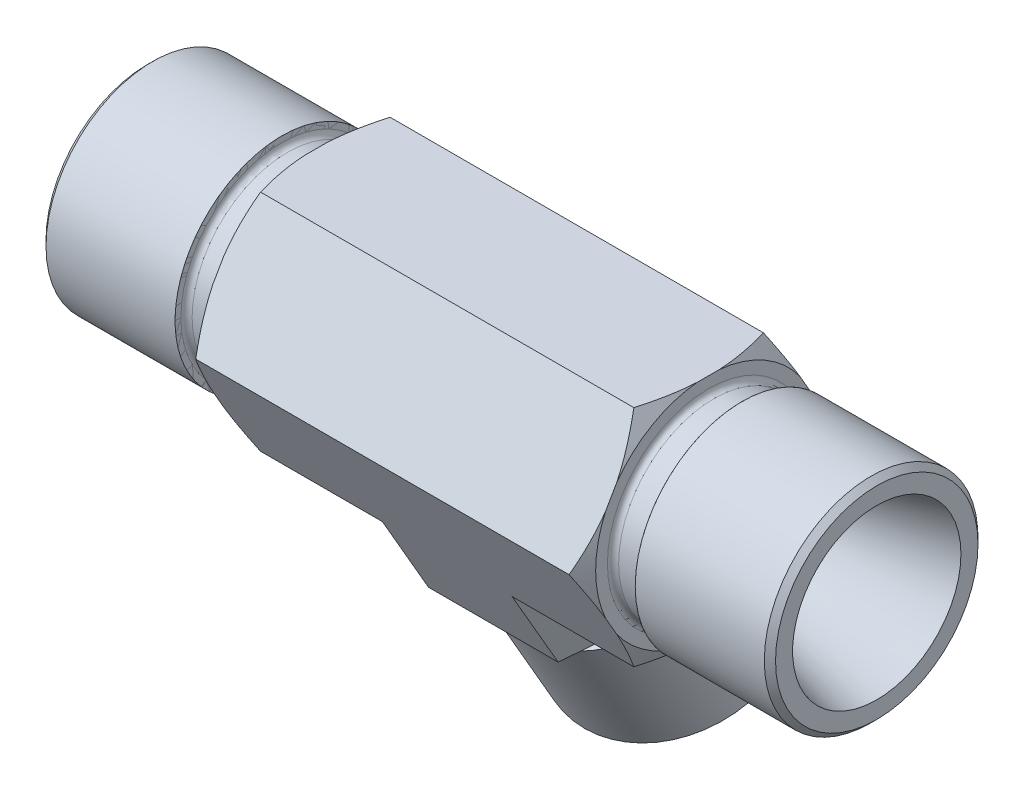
ISO-10303-21;
HEADER;
FILE_DESCRIPTION(('STEP AP214'),'2;1');
FILE_NAME('part.step','',(''),(''),'','','');
FILE_SCHEMA(('AUTOMOTIVE_DESIGN { 1 0 10303 214 1 1 1 1 }'));
ENDSEC;
DATA;
#1=APPLICATION_CONTEXT('core data for automotive mechanical design processes');
#2=APPLICATION_PROTOCOL_DEFINITION('international standard','automotive_design',2000,#1);
#3=PRODUCT_CONTEXT('',#1,'mechanical');
#4=PRODUCT('Part','Part','',(#3));
#5=PRODUCT_RELATED_PRODUCT_CATEGORY('part','',(#4));
#6=PRODUCT_DEFINITION_FORMATION('','',#4);
#7=PRODUCT_DEFINITION_CONTEXT('part definition',#1,'design');
#8=PRODUCT_DEFINITION('design','',#6,#7);
#9=PRODUCT_DEFINITION_SHAPE('','',#8);
#10=(LENGTH_UNIT() NAMED_UNIT(*) SI_UNIT(.MILLI.,.METRE.));
#11=(NAMED_UNIT(*) PLANE_ANGLE_UNIT() SI_UNIT($,.RADIAN.));
#12=(NAMED_UNIT(*) SI_UNIT($,.STERADIAN.) SOLID_ANGLE_UNIT());
#13=UNCERTAINTY_MEASURE_WITH_UNIT(LENGTH_MEASURE(1.E-05),#10,'distance_accuracy_value','');
#14=(GEOMETRIC_REPRESENTATION_CONTEXT(3) GLOBAL_UNCERTAINTY_ASSIGNED_CONTEXT((#13)) GLOBAL_UNIT_ASSIGNED_CONTEXT((#10,
#11,#12)) REPRESENTATION_CONTEXT('',''));
#15=CARTESIAN_POINT('',(0.,0.,0.));
#16=DIRECTION('',(0.,0.,1.));
#17=DIRECTION('',(1.,0.,0.));
#18=AXIS2_PLACEMENT_3D('',#15,#16,#17);
#19=CARTESIAN_POINT('',(-15.,0.,0.));
#20=DIRECTION('',(-1.,0.,0.));
#21=DIRECTION('',(0.,0.,1.));
#22=AXIS2_PLACEMENT_3D('',#19,#20,#21);
#23=CYLINDRICAL_SURFACE('',#22,8.);
#24=CARTESIAN_POINT('',(-3.,0.,0.));
#25=DIRECTION('',(-1.,0.,0.));
#26=DIRECTION('',(0.,0.,1.));
#27=AXIS2_PLACEMENT_3D('',#24,#25,#26);
#28=CIRCLE('',#27,8.);
#29=CARTESIAN_POINT('',(-3.,0.,8.));
#30=VERTEX_POINT('',#29);
#31=EDGE_CURVE('P0_E20',#30,#30,#28,.T.);
#32=ORIENTED_EDGE('',*,*,#31,.T.);
#33=EDGE_LOOP('',(#32));
#34=FACE_BOUND('',#33,.T.);
#35=CARTESIAN_POINT('',(-15.,0.,0.));
#36=DIRECTION('',(-1.,0.,0.));
#37=DIRECTION('',(0.,0.,1.));
#38=AXIS2_PLACEMENT_3D('',#35,#36,#37);
#39=CIRCLE('',#38,8.);
#40=CARTESIAN_POINT('',(-15.,0.,8.));
#41=VERTEX_POINT('',#40);
#42=EDGE_CURVE('P0_E11',#41,#41,#39,.F.);
#43=ORIENTED_EDGE('',*,*,#42,.T.);
#44=EDGE_LOOP('',(#43));
#45=FACE_BOUND('',#44,.T.);
#46=ADVANCED_FACE('P0_F16',(#34,#45),#23,.T.);
#47=CARTESIAN_POINT('',(-3.,0.,0.));
#48=DIRECTION('',(-1.,0.,0.));
#49=DIRECTION('',(0.,0.,1.));
#50=AXIS2_PLACEMENT_3D('',#47,#48,#49);
#51=PLANE('',#50);
#52=ORIENTED_EDGE('',*,*,#31,.F.);
#53=EDGE_LOOP('',(#52));
#54=FACE_BOUND('',#53,.T.);
#55=CARTESIAN_POINT('',(-3.,9.52,0.));
#56=CARTESIAN_POINT('',(-3.,9.51990265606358,-0.873694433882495));
#57=CARTESIAN_POINT('',(-3.,9.36106710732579,-1.73228825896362));
#58=CARTESIAN_POINT('',(-3.,9.19267229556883,-2.64255517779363));
#59=CARTESIAN_POINT('',(-3.,8.85158462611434,-3.50426163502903));
#60=CARTESIAN_POINT('',(-3.,8.49656731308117,-4.40115923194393));
#61=CARTESIAN_POINT('',(-3.,7.96819726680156,-5.20943685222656));
#62=CARTESIAN_POINT('',(-3.,7.42908168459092,-6.03415252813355));
#63=CARTESIAN_POINT('',(-3.,6.73165655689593,-6.73165655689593));
#64=CARTESIAN_POINT('',(-3.,6.03498882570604,-7.42840310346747));
#65=CARTESIAN_POINT('',(-3.,5.20943685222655,-7.96819726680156));
#66=CARTESIAN_POINT('',(-3.,4.40209628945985,-8.49608374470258));
#67=CARTESIAN_POINT('',(-3.,3.50426163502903,-8.85158462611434));
#68=CARTESIAN_POINT('',(-3.,2.64356407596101,-9.192380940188));
#69=CARTESIAN_POINT('',(-3.,1.73228825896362,-9.36106710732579));
#70=CARTESIAN_POINT('',(-3.,0.873964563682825,-9.51995131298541));
#71=CARTESIAN_POINT('',(-3.,0.,-9.52));
#72=CARTESIAN_POINT('',(-3.,-0.872905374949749,-9.52004862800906));
#73=CARTESIAN_POINT('',(-3.,-1.73228825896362,-9.36106710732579));
#74=CARTESIAN_POINT('',(-3.,-2.64255517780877,-9.19267229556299));
#75=CARTESIAN_POINT('',(-3.,-3.50426163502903,-8.85158462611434));
#76=CARTESIAN_POINT('',(-3.,-4.40115923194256,-8.49656731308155));
#77=CARTESIAN_POINT('',(-3.,-5.20943685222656,-7.96819726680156));
#78=CARTESIAN_POINT('',(-3.,-6.03415252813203,-7.42908168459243));
#79=CARTESIAN_POINT('',(-3.,-6.73165655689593,-6.73165655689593));
#80=CARTESIAN_POINT('',(-3.,-7.42840310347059,-6.03498882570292));
#81=CARTESIAN_POINT('',(-3.,-7.96819726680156,-5.20943685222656));
#82=CARTESIAN_POINT('',(-3.,-8.49608374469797,-4.40209628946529));
#83=CARTESIAN_POINT('',(-3.,-8.85158462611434,-3.50426163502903));
#84=CARTESIAN_POINT('',(-3.,-9.19238094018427,-2.64356407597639));
#85=CARTESIAN_POINT('',(-3.,-9.36106710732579,-1.73228825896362));
#86=CARTESIAN_POINT('',(-3.,-9.51990259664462,-0.874227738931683));
#87=CARTESIAN_POINT('',(-3.,-9.52,0.));
#88=B_SPLINE_CURVE_WITH_KNOTS('',2,(#55,#56,#57,#58,#59,#60,#61,#62,#63,#64,#65,#66,#67,#68,#69,
#70,#71,#72,#73,#74,#75,#76,#77,#78,#79,#80,#81,#82,#83,#84,#85,#86,#87),.UNSPECIFIED.,.F.,.F.,
(3,2,2,2,2,2,2,2,2,2,2,2,2,2,2,2,3),(0.,0.0625,0.125,0.1875,0.25,0.3125,0.375,0.4375,0.5,0.5625,
0.625,0.6875,0.75,0.8125,0.875,0.9375,1.),.UNSPECIFIED.);
#89=CARTESIAN_POINT('',(-3.,9.52,0.));
#90=VERTEX_POINT('',#89);
#91=CARTESIAN_POINT('',(-3.,-9.52,0.));
#92=VERTEX_POINT('',#91);
#93=EDGE_CURVE('P0_E30',#90,#92,#88,.T.);
#94=ORIENTED_EDGE('',*,*,#93,.T.);
#95=CARTESIAN_POINT('',(-3.,-9.52,0.));
#96=CARTESIAN_POINT('',(-3.,-9.51990265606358,0.873694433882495));
#97=CARTESIAN_POINT('',(-3.,-9.36106710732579,1.73228825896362));
#98=CARTESIAN_POINT('',(-3.,-9.19267229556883,2.64255517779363));
#99=CARTESIAN_POINT('',(-3.,-8.85158462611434,3.50426163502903));
#100=CARTESIAN_POINT('',(-3.,-8.49656731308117,4.40115923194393));
#101=CARTESIAN_POINT('',(-3.,-7.96819726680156,5.20943685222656));
#102=CARTESIAN_POINT('',(-3.,-7.42908168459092,6.03415252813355));
#103=CARTESIAN_POINT('',(-3.,-6.73165655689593,6.73165655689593));
#104=CARTESIAN_POINT('',(-3.,-6.03498882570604,7.42840310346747));
#105=CARTESIAN_POINT('',(-3.,-5.20943685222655,7.96819726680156));
#106=CARTESIAN_POINT('',(-3.,-4.40209628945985,8.49608374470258));
#107=CARTESIAN_POINT('',(-3.,-3.50426163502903,8.85158462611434));
#108=CARTESIAN_POINT('',(-3.,-2.64356407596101,9.192380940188));
#109=CARTESIAN_POINT('',(-3.,-1.73228825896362,9.36106710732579));
#110=CARTESIAN_POINT('',(-3.,-0.873964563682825,9.51995131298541));
#111=CARTESIAN_POINT('',(-3.,0.,9.52));
#112=CARTESIAN_POINT('',(-3.,0.872905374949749,9.52004862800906));
#113=CARTESIAN_POINT('',(-3.,1.73228825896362,9.36106710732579));
#114=CARTESIAN_POINT('',(-3.,2.64255517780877,9.19267229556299));
#115=CARTESIAN_POINT('',(-3.,3.50426163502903,8.85158462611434));
#116=CARTESIAN_POINT('',(-3.,4.40115923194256,8.49656731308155));
#117=CARTESIAN_POINT('',(-3.,5.20943685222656,7.96819726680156));
#118=CARTESIAN_POINT('',(-3.,6.03415252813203,7.42908168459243));
#119=CARTESIAN_POINT('',(-3.,6.73165655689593,6.73165655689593));
#120=CARTESIAN_POINT('',(-3.,7.42840310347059,6.03498882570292));
#121=CARTESIAN_POINT('',(-3.,7.96819726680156,5.20943685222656));
#122=CARTESIAN_POINT('',(-3.,8.49608374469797,4.40209628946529));
#123=CARTESIAN_POINT('',(-3.,8.85158462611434,3.50426163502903));
#124=CARTESIAN_POINT('',(-3.,9.19238094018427,2.64356407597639));
#125=CARTESIAN_POINT('',(-3.,9.36106710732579,1.73228825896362));
#126=CARTESIAN_POINT('',(-3.,9.51990259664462,0.874227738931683));
#127=CARTESIAN_POINT('',(-3.,9.52,0.));
#128=B_SPLINE_CURVE_WITH_KNOTS('',2,(#95,#96,#97,#98,#99,#100,#101,#102,#103,#104,#105,#106,
#107,#108,#109,#110,#111,#112,#113,#114,#115,#116,#117,#118,#119,#120,#121,#122,#123,#124,#125,
#126,#127),.UNSPECIFIED.,.F.,.F.,(3,2,2,2,2,2,2,2,2,2,2,2,2,2,2,2,3),(0.,0.0625,0.125,0.1875,
0.25,0.3125,0.375,0.4375,0.5,0.5625,0.625,0.6875,0.75,0.8125,0.875,0.9375,1.),.UNSPECIFIED.);
#129=EDGE_CURVE('P0_E33',#92,#90,#128,.T.);
#130=ORIENTED_EDGE('',*,*,#129,.T.);
#131=EDGE_LOOP('',(#94,#130));
#132=FACE_BOUND('',#131,.T.);
#133=ADVANCED_FACE('P0_F17',(#54,#132),#51,.T.);
#134=OPEN_SHELL('',(#46,#133));
#135=SHELL_BASED_SURFACE_MODEL('P0_B1',(#134));
#136=CARTESIAN_POINT('',(50.,0.,0.));
#137=DIRECTION('',(-1.,0.,0.));
#138=DIRECTION('',(0.,0.,1.));
#139=AXIS2_PLACEMENT_3D('',#136,#137,#138);
#140=CYLINDRICAL_SURFACE('',#139,8.);
#141=CARTESIAN_POINT('',(38.,0.,0.));
#142=DIRECTION('',(-1.,0.,0.));
#143=DIRECTION('',(0.,0.,1.));
#144=AXIS2_PLACEMENT_3D('',#141,#142,#143);
#145=CIRCLE('',#144,8.);
#146=CARTESIAN_POINT('',(38.,0.,8.));
#147=VERTEX_POINT('',#146);
#148=EDGE_CURVE('P1_E20',#147,#147,#145,.F.);
#149=ORIENTED_EDGE('',*,*,#148,.T.);
#150=EDGE_LOOP('',(#149));
#151=FACE_BOUND('',#150,.T.);
#152=CARTESIAN_POINT('',(50.,0.,0.));
#153=DIRECTION('',(-1.,0.,0.));
#154=DIRECTION('',(0.,0.,1.));
#155=AXIS2_PLACEMENT_3D('',#152,#153,#154);
#156=CIRCLE('',#155,8.);
#157=CARTESIAN_POINT('',(50.,0.,8.));
#158=VERTEX_POINT('',#157);
#159=EDGE_CURVE('P1_E11',#158,#158,#156,.T.);
#160=ORIENTED_EDGE('',*,*,#159,.T.);
#161=EDGE_LOOP('',(#160));
#162=FACE_BOUND('',#161,.T.);
#163=ADVANCED_FACE('P1_F16',(#151,#162),#140,.T.);
#164=CARTESIAN_POINT('',(38.,0.,0.));
#165=DIRECTION('',(-1.,0.,0.));
#166=DIRECTION('',(0.,0.,1.));
#167=AXIS2_PLACEMENT_3D('',#164,#165,#166);
#168=PLANE('',#167);
#169=ORIENTED_EDGE('',*,*,#148,.F.);
#170=EDGE_LOOP('',(#169));
#171=FACE_BOUND('',#170,.T.);
#172=CARTESIAN_POINT('',(38.,-9.52,0.));
#173=CARTESIAN_POINT('',(38.,-9.51990265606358,0.873694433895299));
#174=CARTESIAN_POINT('',(38.,-9.36106710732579,1.73228825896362));
#175=CARTESIAN_POINT('',(38.,-9.19267229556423,2.64255517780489));
#176=CARTESIAN_POINT('',(38.,-8.85158462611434,3.50426163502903));
#177=CARTESIAN_POINT('',(38.,-8.49656731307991,4.40115923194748));
#178=CARTESIAN_POINT('',(38.,-7.96819726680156,5.20943685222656));
#179=CARTESIAN_POINT('',(38.,-7.4290816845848,6.03415252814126));
#180=CARTESIAN_POINT('',(38.,-6.73165655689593,6.73165655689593));
#181=CARTESIAN_POINT('',(38.,-6.03498882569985,7.42840310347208));
#182=CARTESIAN_POINT('',(38.,-5.20943685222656,7.96819726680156));
#183=CARTESIAN_POINT('',(38.,-4.40209628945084,8.49608374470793));
#184=CARTESIAN_POINT('',(38.,-3.50426163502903,8.85158462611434));
#185=CARTESIAN_POINT('',(38.,-2.6435640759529,9.1923809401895));
#186=CARTESIAN_POINT('',(38.,-1.73228825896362,9.36106710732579));
#187=CARTESIAN_POINT('',(38.,-0.873964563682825,9.51995131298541));
#188=CARTESIAN_POINT('',(38.,0.,9.52));
#189=CARTESIAN_POINT('',(38.,0.872905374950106,9.52004862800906));
#190=CARTESIAN_POINT('',(38.,1.73228825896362,9.36106710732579));
#191=CARTESIAN_POINT('',(38.,2.64255517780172,9.19267229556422));
#192=CARTESIAN_POINT('',(38.,3.50426163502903,8.85158462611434));
#193=CARTESIAN_POINT('',(38.,4.40115923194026,8.49656731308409));
#194=CARTESIAN_POINT('',(38.,5.20943685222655,7.96819726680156));
#195=CARTESIAN_POINT('',(38.,6.03415252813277,7.4290816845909));
#196=CARTESIAN_POINT('',(38.,6.73165655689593,6.73165655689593));
#197=CARTESIAN_POINT('',(38.,7.42840310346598,6.03498882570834));
#198=CARTESIAN_POINT('',(38.,7.96819726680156,5.20943685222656));
#199=CARTESIAN_POINT('',(38.,8.49608374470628,4.4020962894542));
#200=CARTESIAN_POINT('',(38.,8.85158462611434,3.50426163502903));
#201=CARTESIAN_POINT('',(38.,9.19238094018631,2.64356407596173));
#202=CARTESIAN_POINT('',(38.,9.36106710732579,1.73228825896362));
#203=CARTESIAN_POINT('',(38.,9.51990259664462,0.874227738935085));
#204=CARTESIAN_POINT('',(38.,9.52,0.));
#205=B_SPLINE_CURVE_WITH_KNOTS('',2,(#172,#173,#174,#175,#176,#177,#178,#179,#180,#181,#182,
#183,#184,#185,#186,#187,#188,#189,#190,#191,#192,#193,#194,#195,#196,#197,#198,#199,#200,#201,
#202,#203,#204),.UNSPECIFIED.,.F.,.F.,(3,2,2,2,2,2,2,2,2,2,2,2,2,2,2,2,3),(0.,0.0625,0.125,
0.1875,0.25,0.3125,0.375,0.4375,0.5,0.5625,0.625,0.6875,0.75,0.8125,0.875,0.9375,1.),.UNSPECIFIED.);
#206=CARTESIAN_POINT('',(38.,-9.52,0.));
#207=VERTEX_POINT('',#206);
#208=CARTESIAN_POINT('',(38.,9.52,0.));
#209=VERTEX_POINT('',#208);
#210=EDGE_CURVE('P1_E28',#207,#209,#205,.T.);
#211=ORIENTED_EDGE('',*,*,#210,.F.);
#212=CARTESIAN_POINT('',(38.,9.52,0.));
#213=CARTESIAN_POINT('',(38.,9.51990265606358,-0.873694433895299));
#214=CARTESIAN_POINT('',(38.,9.36106710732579,-1.73228825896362));
#215=CARTESIAN_POINT('',(38.,9.19267229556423,-2.64255517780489));
#216=CARTESIAN_POINT('',(38.,8.85158462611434,-3.50426163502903));
#217=CARTESIAN_POINT('',(38.,8.49656731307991,-4.40115923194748));
#218=CARTESIAN_POINT('',(38.,7.96819726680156,-5.20943685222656));
#219=CARTESIAN_POINT('',(38.,7.4290816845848,-6.03415252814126));
#220=CARTESIAN_POINT('',(38.,6.73165655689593,-6.73165655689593));
#221=CARTESIAN_POINT('',(38.,6.03498882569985,-7.42840310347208));
#222=CARTESIAN_POINT('',(38.,5.20943685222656,-7.96819726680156));
#223=CARTESIAN_POINT('',(38.,4.40209628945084,-8.49608374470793));
#224=CARTESIAN_POINT('',(38.,3.50426163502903,-8.85158462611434));
#225=CARTESIAN_POINT('',(38.,2.6435640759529,-9.1923809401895));
#226=CARTESIAN_POINT('',(38.,1.73228825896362,-9.36106710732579));
#227=CARTESIAN_POINT('',(38.,0.873964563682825,-9.51995131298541));
#228=CARTESIAN_POINT('',(38.,0.,-9.52));
#229=CARTESIAN_POINT('',(38.,-0.872905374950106,-9.52004862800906));
#230=CARTESIAN_POINT('',(38.,-1.73228825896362,-9.36106710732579));
#231=CARTESIAN_POINT('',(38.,-2.64255517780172,-9.19267229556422));
#232=CARTESIAN_POINT('',(38.,-3.50426163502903,-8.85158462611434));
#233=CARTESIAN_POINT('',(38.,-4.40115923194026,-8.49656731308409));
#234=CARTESIAN_POINT('',(38.,-5.20943685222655,-7.96819726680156));
#235=CARTESIAN_POINT('',(38.,-6.03415252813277,-7.4290816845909));
#236=CARTESIAN_POINT('',(38.,-6.73165655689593,-6.73165655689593));
#237=CARTESIAN_POINT('',(38.,-7.42840310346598,-6.03498882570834));
#238=CARTESIAN_POINT('',(38.,-7.96819726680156,-5.20943685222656));
#239=CARTESIAN_POINT('',(38.,-8.49608374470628,-4.4020962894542));
#240=CARTESIAN_POINT('',(38.,-8.85158462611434,-3.50426163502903));
#241=CARTESIAN_POINT('',(38.,-9.19238094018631,-2.64356407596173));
#242=CARTESIAN_POINT('',(38.,-9.36106710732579,-1.73228825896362));
#243=CARTESIAN_POINT('',(38.,-9.51990259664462,-0.874227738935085));
#244=CARTESIAN_POINT('',(38.,-9.52,0.));
#245=B_SPLINE_CURVE_WITH_KNOTS('',2,(#212,#213,#214,#215,#216,#217,#218,#219,#220,#221,#222,
#223,#224,#225,#226,#227,#228,#229,#230,#231,#232,#233,#234,#235,#236,#237,#238,#239,#240,#241,
#242,#243,#244),.UNSPECIFIED.,.F.,.F.,(3,2,2,2,2,2,2,2,2,2,2,2,2,2,2,2,3),(0.,0.0625,0.125,
0.1875,0.25,0.3125,0.375,0.4375,0.5,0.5625,0.625,0.6875,0.75,0.8125,0.875,0.9375,1.),.UNSPECIFIED.);
#246=EDGE_CURVE('P1_E32',#209,#207,#245,.T.);
#247=ORIENTED_EDGE('',*,*,#246,.F.);
#248=EDGE_LOOP('',(#211,#247));
#249=FACE_BOUND('',#248,.T.);
#250=ADVANCED_FACE('P1_F17',(#171,#249),#168,.F.);
#251=OPEN_SHELL('',(#163,#250));
#252=SHELL_BASED_SURFACE_MODEL('P1_B1',(#251));
#253=CARTESIAN_POINT('',(17.5,-25.11473670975,-14.5));
#254=DIRECTION('',(0.,0.866025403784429,0.500000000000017));
#255=DIRECTION('',(0.,-0.500000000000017,0.866025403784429));
#256=AXIS2_PLACEMENT_3D('',#253,#254,#255);
#257=CYLINDRICAL_SURFACE('',#256,8.);
#258=CARTESIAN_POINT('',(17.5,-12.1243556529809,-6.99999999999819));
#259=DIRECTION('',(0.,0.866025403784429,0.500000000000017));
#260=DIRECTION('',(0.,-0.500000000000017,0.866025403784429));
#261=AXIS2_PLACEMENT_3D('',#258,#259,#260);
#262=CIRCLE('',#261,8.);
#263=CARTESIAN_POINT('',(17.5,-16.124355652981,-0.0717967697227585));
#264=VERTEX_POINT('',#263);
#265=EDGE_CURVE('P2_E15',#264,#264,#262,.F.);
#266=ORIENTED_EDGE('',*,*,#265,.T.);
#267=EDGE_LOOP('',(#266));
#268=FACE_BOUND('',#267,.T.);
#269=CARTESIAN_POINT('',(17.5,-25.1147367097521,-14.5000000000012));
#270=DIRECTION('',(0.,0.866025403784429,0.500000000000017));
#271=DIRECTION('',(0.,-0.500000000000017,0.866025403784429));
#272=AXIS2_PLACEMENT_3D('',#269,#270,#271);
#273=CIRCLE('',#272,8.);
#274=CARTESIAN_POINT('',(17.5,-29.1147367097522,-7.57179676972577));
#275=VERTEX_POINT('',#274);
#276=EDGE_CURVE('P2_E10',#275,#275,#273,.T.);
#277=ORIENTED_EDGE('',*,*,#276,.T.);
#278=EDGE_LOOP('',(#277));
#279=FACE_BOUND('',#278,.T.);
#280=ADVANCED_FACE('P2_F14',(#268,#279),#257,.T.);
#281=OPEN_SHELL('',(#280));
#282=SHELL_BASED_SURFACE_MODEL('P2_B1',(#281));
#283=CARTESIAN_POINT('',(0.,0.,0.));
#284=DIRECTION('',(1.,0.,0.));
#285=DIRECTION('',(0.,0.,-1.));
#286=AXIS2_PLACEMENT_3D('',#283,#284,#285);
#287=CYLINDRICAL_SURFACE('',#286,4.);
#288=CARTESIAN_POINT('',(35.,0.,0.));
#289=DIRECTION('',(1.,0.,0.));
#290=DIRECTION('',(0.,0.,-1.));
#291=AXIS2_PLACEMENT_3D('',#288,#289,#290);
#292=CIRCLE('',#291,4.);
#293=CARTESIAN_POINT('',(35.,0.,-4.));
#294=VERTEX_POINT('',#293);
#295=EDGE_CURVE('P3_E653',#294,#294,#292,.F.);
#296=ORIENTED_EDGE('',*,*,#295,.F.);
#297=EDGE_LOOP('',(#296));
#298=FACE_BOUND('',#297,.T.);
#299=CARTESIAN_POINT('',(0.,0.,0.));
#300=DIRECTION('',(1.,0.,0.));
#301=DIRECTION('',(0.,0.,-1.));
#302=AXIS2_PLACEMENT_3D('',#299,#300,#301);
#303=CIRCLE('',#302,4.);
#304=CARTESIAN_POINT('',(0.,0.,-4.));
#305=VERTEX_POINT('',#304);
#306=EDGE_CURVE('P3_E650',#305,#305,#303,.F.);
#307=ORIENTED_EDGE('',*,*,#306,.T.);
#308=EDGE_LOOP('',(#307));
#309=FACE_BOUND('',#308,.T.);
#310=CARTESIAN_POINT('',(14.5,-3.46410161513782,-1.99999999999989));
#311=CARTESIAN_POINT('',(14.5000086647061,-3.39077058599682,-2.12699639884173));
#312=CARTESIAN_POINT('',(14.5108263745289,-3.31036761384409,-2.24999641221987));
#313=CARTESIAN_POINT('',(14.5533824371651,-3.13851244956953,-2.48412927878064));
#314=CARTESIAN_POINT('',(14.5851417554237,-3.04704925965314,-2.59525010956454));
#315=CARTESIAN_POINT('',(14.6674184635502,-2.85741838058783,-2.80264413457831));
#316=CARTESIAN_POINT('',(14.7178328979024,-2.75928985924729,-2.89899479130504));
#317=CARTESIAN_POINT('',(14.8350620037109,-2.55954805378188,-3.07678660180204));
#318=CARTESIAN_POINT('',(14.9018775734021,-2.45793457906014,-3.15822693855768));
#319=CARTESIAN_POINT('',(15.0565267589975,-2.24508289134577,-3.31338517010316));
#320=CARTESIAN_POINT('',(15.1457324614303,-2.13382340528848,-3.38569294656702));
#321=CARTESIAN_POINT('',(15.3390081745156,-1.91472226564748,-3.5142547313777));
#322=CARTESIAN_POINT('',(15.4431000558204,-1.80688593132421,-3.57048474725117));
#323=CARTESIAN_POINT('',(15.6205349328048,-1.64021949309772,-3.64890172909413));
#324=CARTESIAN_POINT('',(15.6896292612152,-1.57896531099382,-3.6757311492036));
#325=CARTESIAN_POINT('',(15.8325873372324,-1.46012092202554,-3.72453606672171));
#326=CARTESIAN_POINT('',(15.9064525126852,-1.40253182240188,-3.74651010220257));
#327=CARTESIAN_POINT('',(16.0587693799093,-1.29225574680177,-3.78596093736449));
#328=CARTESIAN_POINT('',(16.1372154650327,-1.23956297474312,-3.80344309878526));
#329=CARTESIAN_POINT('',(16.2987060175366,-1.1404097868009,-3.83433993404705));
#330=CARTESIAN_POINT('',(16.3817497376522,-1.09394836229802,-3.84775526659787));
#331=CARTESIAN_POINT('',(16.5789623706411,-0.995676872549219,-3.87452765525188));
#332=CARTESIAN_POINT('',(16.6947699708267,-0.946707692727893,-3.88656529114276));
#333=CARTESIAN_POINT('',(16.9327972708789,-0.867031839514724,-3.90511930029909));
#334=CARTESIAN_POINT('',(17.0550015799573,-0.83628334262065,-3.91164833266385));
#335=CARTESIAN_POINT('',(17.3043619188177,-0.796904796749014,-3.91987113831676));
#336=CARTESIAN_POINT('',(17.4315525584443,-0.788475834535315,-3.92152096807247));
#337=CARTESIAN_POINT('',(17.6852304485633,-0.795784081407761,-3.92004268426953));
#338=CARTESIAN_POINT('',(17.8117174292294,-0.811529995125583,-3.91691284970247));
#339=CARTESIAN_POINT('',(18.0463826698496,-0.861730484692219,-3.90614402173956));
#340=CARTESIAN_POINT('',(18.1550730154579,-0.894005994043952,-3.89902262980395));
#341=CARTESIAN_POINT('',(18.3668781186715,-0.972471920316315,-3.88019713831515));
#342=CARTESIAN_POINT('',(18.4699874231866,-1.01867566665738,-3.86848864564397));
#343=CARTESIAN_POINT('',(18.7325133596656,-1.1539911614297,-3.83089991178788));
#344=CARTESIAN_POINT('',(18.8868019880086,-1.2518632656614,-3.8007362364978));
#345=CARTESIAN_POINT('',(19.178394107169,-1.46505695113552,-3.72378001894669));
#346=CARTESIAN_POINT('',(19.3156552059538,-1.58042055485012,-3.67694705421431));
#347=CARTESIAN_POINT('',(19.5754969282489,-1.82421489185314,-3.56242237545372));
#348=CARTESIAN_POINT('',(19.6976228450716,-1.95290084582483,-3.49423682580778));
#349=CARTESIAN_POINT('',(19.9205122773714,-2.21422542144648,-3.3347498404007));
#350=CARTESIAN_POINT('',(20.0213135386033,-2.34685657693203,-3.24348988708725));
#351=CARTESIAN_POINT('',(20.1799945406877,-2.58324568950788,-3.05692281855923));
#352=CARTESIAN_POINT('',(20.242427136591,-2.68746739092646,-2.96608500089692));
#353=CARTESIAN_POINT('',(20.3484920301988,-2.89038623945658,-2.76868170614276));
#354=CARTESIAN_POINT('',(20.3921536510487,-2.98909179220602,-2.66214111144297));
#355=CARTESIAN_POINT('',(20.449831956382,-3.15285404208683,-2.46405607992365));
#356=CARTESIAN_POINT('',(20.4685738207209,-3.22006188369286,-2.37564126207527));
#357=CARTESIAN_POINT('',(20.4936614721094,-3.34758447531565,-2.19229276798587));
#358=CARTESIAN_POINT('',(20.5000066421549,-3.40789888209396,-2.09735876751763));
#359=CARTESIAN_POINT('',(20.4999913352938,-3.5374182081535,-1.87299526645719));
#360=CARTESIAN_POINT('',(20.4891736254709,-3.60373785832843,-1.74186424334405));
#361=CARTESIAN_POINT('',(20.4466175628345,-3.72057528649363,-1.47596687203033));
#362=CARTESIAN_POINT('',(20.4148582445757,-3.77107715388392,-1.34119701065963));
#363=CARTESIAN_POINT('',(20.3325815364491,-3.85587020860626,-1.07327483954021));
#364=CARTESIAN_POINT('',(20.2821671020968,-3.89024806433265,-0.940117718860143));
#365=CARTESIAN_POINT('',(20.1649379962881,-3.94434938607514,-0.678240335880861));
#366=CARTESIAN_POINT('',(20.0981224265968,-3.96407204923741,-0.549520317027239));
#367=CARTESIAN_POINT('',(19.9434732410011,-3.99201717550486,-0.287606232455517));
#368=CARTESIAN_POINT('',(19.8542675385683,-3.99900780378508,-0.155098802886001));
#369=CARTESIAN_POINT('',(19.6609918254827,-4.00079500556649,0.0989292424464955));
#370=CARTESIAN_POINT('',(19.5568999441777,-3.99557346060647,0.220433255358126));
#371=CARTESIAN_POINT('',(19.3794650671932,-3.98015133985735,0.403979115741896));
#372=CARTESIAN_POINT('',(19.3103707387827,-3.97275920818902,0.470441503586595));
#373=CARTESIAN_POINT('',(19.1674126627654,-3.95560331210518,0.597766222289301));
#374=CARTESIAN_POINT('',(19.0935474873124,-3.94583883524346,0.658626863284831));
#375=CARTESIAN_POINT('',(18.9412306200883,-3.92486622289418,0.773854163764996));
#376=CARTESIAN_POINT('',(18.8627845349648,-3.91365983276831,0.828228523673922));
#377=CARTESIAN_POINT('',(18.7012939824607,-3.89084068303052,0.929546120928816));
#378=CARTESIAN_POINT('',(18.6182502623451,-3.87922798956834,0.976490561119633));
#379=CARTESIAN_POINT('',(18.4210376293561,-3.85327781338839,1.07498236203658));
#380=CARTESIAN_POINT('',(18.3052300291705,-3.8392181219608,1.12340973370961));
#381=CARTESIAN_POINT('',(18.0672027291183,-3.81544843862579,1.20168805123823));
#382=CARTESIAN_POINT('',(17.9449984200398,-3.80572849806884,1.23158154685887));
#383=CARTESIAN_POINT('',(17.6956380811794,-3.79316038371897,1.26979577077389));
#384=CARTESIAN_POINT('',(17.5684474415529,-3.79037469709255,1.27792038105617));
#385=CARTESIAN_POINT('',(17.314769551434,-3.79274858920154,1.27085211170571));
#386=CARTESIAN_POINT('',(17.188282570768,-3.79791102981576,1.25565083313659));
#387=CARTESIAN_POINT('',(16.9536173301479,-3.81368519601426,1.20679151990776));
#388=CARTESIAN_POINT('',(16.8449269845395,-3.8236556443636,1.17527941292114));
#389=CARTESIAN_POINT('',(16.6331218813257,-3.84658525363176,1.09791318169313));
#390=CARTESIAN_POINT('',(16.5300125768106,-3.85954727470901,1.05204531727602));
#391=CARTESIAN_POINT('',(16.2674866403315,-3.89465222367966,0.91606429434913));
#392=CARTESIAN_POINT('',(16.1131980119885,-3.91746576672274,0.816222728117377));
#393=CARTESIAN_POINT('',(15.8216058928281,-3.9574165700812,0.593113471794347));
#394=CARTESIAN_POINT('',(15.6843447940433,-3.9745398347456,0.469789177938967));
#395=CARTESIAN_POINT('',(15.4245030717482,-3.99725572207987,0.201394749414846));
#396=CARTESIAN_POINT('',(15.3023771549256,-4.00254828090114,0.0558566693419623));
#397=CARTESIAN_POINT('',(15.0794877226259,-3.99509078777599,-0.250200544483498));
#398=CARTESIAN_POINT('',(14.9786864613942,-3.98237292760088,-0.410692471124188));
#399=CARTESIAN_POINT('',(14.8200054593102,-3.93899566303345,-0.708694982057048));
#400=CARTESIAN_POINT('',(14.7575728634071,-3.91243865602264,-0.844372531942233));
#401=CARTESIAN_POINT('',(14.6515079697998,-3.84294181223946,-1.11880705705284));
#402=CARTESIAN_POINT('',(14.6078463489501,-3.80002772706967,-1.25755887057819));
#403=CARTESIAN_POINT('',(14.5501680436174,-3.71036218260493,-1.49842365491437));
#404=CARTESIAN_POINT('',(14.5314261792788,-3.66739662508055,-1.60083476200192));
#405=CARTESIAN_POINT('',(14.5063385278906,-3.57237346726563,-1.80294681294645));
#406=CARTESIAN_POINT('',(14.4999933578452,-3.52031541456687,-1.90264762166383));
#407=CARTESIAN_POINT('',(14.5,-3.46410161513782,-1.99999999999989));
#408=B_SPLINE_CURVE_WITH_KNOTS('',3,(#310,#311,#312,#313,#314,#315,#316,#317,#318,#319,#320,
#321,#322,#323,#324,#325,#326,#327,#328,#329,#330,#331,#332,#333,#334,#335,#336,#337,#338,#339,
#340,#341,#342,#343,#344,#345,#346,#347,#348,#349,#350,#351,#352,#353,#354,#355,#356,#357,#358,
#359,#360,#361,#362,#363,#364,#365,#366,#367,#368,#369,#370,#371,#372,#373,#374,#375,#376,#377,
#378,#379,#380,#381,#382,#383,#384,#385,#386,#387,#388,#389,#390,#391,#392,#393,#394,#395,#396,
#397,#398,#399,#400,#401,#402,#403,#404,#405,#406,#407),.UNSPECIFIED.,.T.,.F.,(4,2,2,2,2,2,2,2,
2,2,2,2,2,2,2,2,2,2,2,2,2,2,2,2,2,2,2,2,2,2,2,2,2,2,2,2,2,2,2,2,2,2,2,2,2,2,2,2,4),(0.,
0.439475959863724,0.879392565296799,1.31691667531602,1.75446475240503,2.23246621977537,
2.71117731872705,2.99937836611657,3.28766607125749,3.57560804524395,3.86350335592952,
4.24106256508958,4.61775173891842,4.99782330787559,5.37803176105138,5.71761018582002,
6.05751462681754,6.61006060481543,7.16395572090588,7.73174720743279,8.29852510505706,
8.75181517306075,9.20439453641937,9.54126944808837,9.87816112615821,10.317637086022,
10.7575536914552,11.1950778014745,11.6326258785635,12.110627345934,12.5893384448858,
12.8775394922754,13.1658271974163,13.4537691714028,13.7416644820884,14.1192236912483,
14.495912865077,14.875984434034,15.2561928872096,15.5957713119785,15.9356757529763,
16.4882217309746,17.0421168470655,17.6099083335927,18.1766862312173,18.6299762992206,
19.0825556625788,19.4194305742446,19.7563222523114),.UNSPECIFIED.);
#409=CARTESIAN_POINT('',(14.5,-3.46410161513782,-1.99999999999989));
#410=VERTEX_POINT('',#409);
#411=EDGE_CURVE('P3_E656',#410,#410,#408,.T.);
#412=ORIENTED_EDGE('',*,*,#411,.T.);
#413=EDGE_LOOP('',(#412));
#414=FACE_BOUND('',#413,.T.);
#415=ADVANCED_FACE('P3_F16',(#298,#309,#414),#287,.F.);
#416=CARTESIAN_POINT('',(0.,0.,0.));
#417=DIRECTION('',(1.,0.,0.));
#418=DIRECTION('',(0.,0.,-1.));
#419=AXIS2_PLACEMENT_3D('',#416,#417,#418);
#420=PLANE('',#419);
#421=ORIENTED_EDGE('',*,*,#306,.F.);
#422=EDGE_LOOP('',(#421));
#423=FACE_BOUND('',#422,.T.);
#424=CARTESIAN_POINT('',(0.,0.,0.));
#425=DIRECTION('',(-1.,0.,0.));
#426=DIRECTION('',(0.,0.,1.));
#427=AXIS2_PLACEMENT_3D('',#424,#425,#426);
#428=CIRCLE('',#427,5.);
#429=CARTESIAN_POINT('',(0.,0.,5.));
#430=VERTEX_POINT('',#429);
#431=EDGE_CURVE('P3_E663',#430,#430,#428,.T.);
#432=ORIENTED_EDGE('',*,*,#431,.T.);
#433=EDGE_LOOP('',(#432));
#434=FACE_BOUND('',#433,.T.);
#435=ADVANCED_FACE('P3_F675',(#423,#434),#420,.F.);
#436=CARTESIAN_POINT('',(35.,0.,0.));
#437=DIRECTION('',(1.,0.,0.));
#438=DIRECTION('',(0.,0.,-1.));
#439=AXIS2_PLACEMENT_3D('',#436,#437,#438);
#440=PLANE('',#439);
#441=ORIENTED_EDGE('',*,*,#295,.T.);
#442=EDGE_LOOP('',(#441));
#443=FACE_BOUND('',#442,.T.);
#444=CARTESIAN_POINT('',(35.,0.,0.));
#445=DIRECTION('',(-1.,0.,0.));
#446=DIRECTION('',(0.,0.,1.));
#447=AXIS2_PLACEMENT_3D('',#444,#445,#446);
#448=CIRCLE('',#447,5.);
#449=CARTESIAN_POINT('',(35.,0.,5.));
#450=VERTEX_POINT('',#449);
#451=EDGE_CURVE('P3_E689',#450,#450,#448,.F.);
#452=ORIENTED_EDGE('',*,*,#451,.T.);
#453=EDGE_LOOP('',(#452));
#454=FACE_BOUND('',#453,.T.);
#455=ADVANCED_FACE('P3_F671',(#443,#454),#440,.T.);
#456=CARTESIAN_POINT('',(17.5,-12.12435565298,-7.));
#457=DIRECTION('',(0.,-0.866025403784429,-0.500000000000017));
#458=DIRECTION('',(0.,0.500000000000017,-0.866025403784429));
#459=AXIS2_PLACEMENT_3D('',#456,#457,#458);
#460=CYLINDRICAL_SURFACE('',#459,3.);
#461=CARTESIAN_POINT('',(17.5,-12.12435565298,-7.));
#462=DIRECTION('',(0.,-0.866025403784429,-0.500000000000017));
#463=DIRECTION('',(0.,0.500000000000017,-0.866025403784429));
#464=AXIS2_PLACEMENT_3D('',#461,#462,#463);
#465=CIRCLE('',#464,3.);
#466=CARTESIAN_POINT('',(17.5,-10.6243556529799,-9.59807621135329));
#467=VERTEX_POINT('',#466);
#468=EDGE_CURVE('P3_E691',#467,#467,#465,.T.);
#469=ORIENTED_EDGE('',*,*,#468,.T.);
#470=EDGE_LOOP('',(#469));
#471=FACE_BOUND('',#470,.T.);
#472=ORIENTED_EDGE('',*,*,#411,.F.);
#473=EDGE_LOOP('',(#472));
#474=FACE_BOUND('',#473,.T.);
#475=ADVANCED_FACE('P3_F665',(#471,#474),#460,.F.);
#476=CARTESIAN_POINT('',(0.,0.,0.));
#477=DIRECTION('',(-1.,0.,0.));
#478=DIRECTION('',(0.,0.,1.));
#479=AXIS2_PLACEMENT_3D('',#476,#477,#478);
#480=CYLINDRICAL_SURFACE('',#479,5.);
#481=ORIENTED_EDGE('',*,*,#431,.F.);
#482=EDGE_LOOP('',(#481));
#483=FACE_BOUND('',#482,.T.);
#484=CARTESIAN_POINT('',(-3.,0.,0.));
#485=DIRECTION('',(-1.,0.,0.));
#486=DIRECTION('',(0.,0.,1.));
#487=AXIS2_PLACEMENT_3D('',#484,#485,#486);
#488=CIRCLE('',#487,5.);
#489=CARTESIAN_POINT('',(-3.,0.,5.));
#490=VERTEX_POINT('',#489);
#491=EDGE_CURVE('P3_E695',#490,#490,#488,.T.);
#492=ORIENTED_EDGE('',*,*,#491,.T.);
#493=EDGE_LOOP('',(#492));
#494=FACE_BOUND('',#493,.T.);
#495=ADVANCED_FACE('P3_F670',(#483,#494),#480,.F.);
#496=CARTESIAN_POINT('',(35.,0.,0.));
#497=DIRECTION('',(-1.,0.,0.));
#498=DIRECTION('',(0.,0.,1.));
#499=AXIS2_PLACEMENT_3D('',#496,#497,#498);
#500=CYLINDRICAL_SURFACE('',#499,5.);
#501=ORIENTED_EDGE('',*,*,#451,.F.);
#502=EDGE_LOOP('',(#501));
#503=FACE_BOUND('',#502,.T.);
#504=CARTESIAN_POINT('',(38.,0.,0.));
#505=DIRECTION('',(-1.,0.,0.));
#506=DIRECTION('',(0.,0.,1.));
#507=AXIS2_PLACEMENT_3D('',#504,#505,#506);
#508=CIRCLE('',#507,5.);
#509=CARTESIAN_POINT('',(38.,0.,5.));
#510=VERTEX_POINT('',#509);
#511=EDGE_CURVE('P3_E700',#510,#510,#508,.T.);
#512=ORIENTED_EDGE('',*,*,#511,.F.);
#513=EDGE_LOOP('',(#512));
#514=FACE_BOUND('',#513,.T.);
#515=ADVANCED_FACE('P3_F1469',(#503,#514),#500,.F.);
#516=CARTESIAN_POINT('',(17.5,-12.12435565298,-7.));
#517=DIRECTION('',(0.,0.866025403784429,0.500000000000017));
#518=DIRECTION('',(0.,-0.500000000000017,0.866025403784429));
#519=AXIS2_PLACEMENT_3D('',#516,#517,#518);
#520=PLANE('',#519);
#521=ORIENTED_EDGE('',*,*,#468,.F.);
#522=EDGE_LOOP('',(#521));
#523=FACE_BOUND('',#522,.T.);
#524=CARTESIAN_POINT('',(17.5,-12.124355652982,-6.99999999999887));
#525=DIRECTION('',(0.,0.866025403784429,0.500000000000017));
#526=DIRECTION('',(0.,-0.500000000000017,0.866025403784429));
#527=AXIS2_PLACEMENT_3D('',#524,#525,#526);
#528=CIRCLE('',#527,4.);
#529=CARTESIAN_POINT('',(17.5,-14.1243556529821,-3.53589838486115));
#530=VERTEX_POINT('',#529);
#531=EDGE_CURVE('P3_E703',#530,#530,#528,.F.);
#532=ORIENTED_EDGE('',*,*,#531,.T.);
#533=EDGE_LOOP('',(#532));
#534=FACE_BOUND('',#533,.T.);
#535=ADVANCED_FACE('P3_F1460',(#523,#534),#520,.F.);
#536=CARTESIAN_POINT('',(-3.,0.,0.));
#537=DIRECTION('',(-1.,0.,0.));
#538=DIRECTION('',(0.,0.,1.));
#539=AXIS2_PLACEMENT_3D('',#536,#537,#538);
#540=PLANE('',#539);
#541=CARTESIAN_POINT('',(-3.,0.,0.));
#542=DIRECTION('',(-1.,0.,0.));
#543=DIRECTION('',(0.,0.,1.));
#544=AXIS2_PLACEMENT_3D('',#541,#542,#543);
#545=CIRCLE('',#544,3.5);
#546=CARTESIAN_POINT('',(-3.,0.,3.5));
#547=VERTEX_POINT('',#546);
#548=EDGE_CURVE('P3_E706',#547,#547,#545,.T.);
#549=ORIENTED_EDGE('',*,*,#548,.T.);
#550=EDGE_LOOP('',(#549));
#551=FACE_BOUND('',#550,.T.);
#552=ORIENTED_EDGE('',*,*,#491,.F.);
#553=EDGE_LOOP('',(#552));
#554=FACE_BOUND('',#553,.T.);
#555=ADVANCED_FACE('P3_F1451',(#551,#554),#540,.F.);
#556=CARTESIAN_POINT('',(38.,0.,0.));
#557=DIRECTION('',(-1.,0.,0.));
#558=DIRECTION('',(0.,0.,1.));
#559=AXIS2_PLACEMENT_3D('',#556,#557,#558);
#560=PLANE('',#559);
#561=CARTESIAN_POINT('',(38.,0.,0.));
#562=DIRECTION('',(-1.,0.,0.));
#563=DIRECTION('',(0.,0.,1.));
#564=AXIS2_PLACEMENT_3D('',#561,#562,#563);
#565=CIRCLE('',#564,3.5);
#566=CARTESIAN_POINT('',(38.,0.,3.5));
#567=VERTEX_POINT('',#566);
#568=EDGE_CURVE('P3_E709',#567,#567,#565,.F.);
#569=ORIENTED_EDGE('',*,*,#568,.T.);
#570=EDGE_LOOP('',(#569));
#571=FACE_BOUND('',#570,.T.);
#572=ORIENTED_EDGE('',*,*,#511,.T.);
#573=EDGE_LOOP('',(#572));
#574=FACE_BOUND('',#573,.T.);
#575=ADVANCED_FACE('P3_F1442',(#571,#574),#560,.T.);
#576=CARTESIAN_POINT('',(17.5,-25.11473670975,-14.5));
#577=DIRECTION('',(0.,0.866025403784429,0.500000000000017));
#578=DIRECTION('',(0.,-0.500000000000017,0.866025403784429));
#579=AXIS2_PLACEMENT_3D('',#576,#577,#578);
#580=CYLINDRICAL_SURFACE('',#579,4.);
#581=ORIENTED_EDGE('',*,*,#531,.F.);
#582=EDGE_LOOP('',(#581));
#583=FACE_BOUND('',#582,.T.);
#584=CARTESIAN_POINT('',(17.5,-14.5989844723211,-8.42872761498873));
#585=DIRECTION('',(0.,0.866025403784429,0.500000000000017));
#586=DIRECTION('',(0.,-0.500000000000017,0.866025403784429));
#587=AXIS2_PLACEMENT_3D('',#584,#585,#586);
#588=CIRCLE('',#587,4.);
#589=CARTESIAN_POINT('',(17.5,-16.5989844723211,-4.96462599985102));
#590=VERTEX_POINT('',#589);
#591=EDGE_CURVE('P3_E712',#590,#590,#588,.T.);
#592=ORIENTED_EDGE('',*,*,#591,.F.);
#593=EDGE_LOOP('',(#592));
#594=FACE_BOUND('',#593,.T.);
#595=ADVANCED_FACE('P3_F1433',(#583,#594),#580,.F.);
#596=CARTESIAN_POINT('',(0.,0.,0.));
#597=DIRECTION('',(-1.,0.,0.));
#598=DIRECTION('',(0.,0.,1.));
#599=AXIS2_PLACEMENT_3D('',#596,#597,#598);
#600=CYLINDRICAL_SURFACE('',#599,3.5);
#601=CARTESIAN_POINT('',(-6.,0.,0.));
#602=DIRECTION('',(-1.,0.,0.));
#603=DIRECTION('',(0.,0.,1.));
#604=AXIS2_PLACEMENT_3D('',#601,#602,#603);
#605=CIRCLE('',#604,3.5);
#606=CARTESIAN_POINT('',(-6.,0.,3.5));
#607=VERTEX_POINT('',#606);
#608=EDGE_CURVE('P3_E715',#607,#607,#605,.F.);
#609=ORIENTED_EDGE('',*,*,#608,.F.);
#610=EDGE_LOOP('',(#609));
#611=FACE_BOUND('',#610,.T.);
#612=ORIENTED_EDGE('',*,*,#548,.F.);
#613=EDGE_LOOP('',(#612));
#614=FACE_BOUND('',#613,.T.);
#615=ADVANCED_FACE('P3_F1424',(#611,#614),#600,.F.);
#616=CARTESIAN_POINT('',(35.,0.,0.));
#617=DIRECTION('',(-1.,0.,0.));
#618=DIRECTION('',(0.,0.,1.));
#619=AXIS2_PLACEMENT_3D('',#616,#617,#618);
#620=CYLINDRICAL_SURFACE('',#619,3.5);
#621=CARTESIAN_POINT('',(41.,0.,0.));
#622=DIRECTION('',(-1.,0.,0.));
#623=DIRECTION('',(0.,0.,1.));
#624=AXIS2_PLACEMENT_3D('',#621,#622,#623);
#625=CIRCLE('',#624,3.5);
#626=CARTESIAN_POINT('',(41.,0.,3.5));
#627=VERTEX_POINT('',#626);
#628=EDGE_CURVE('P3_E718',#627,#627,#625,.F.);
#629=ORIENTED_EDGE('',*,*,#628,.T.);
#630=EDGE_LOOP('',(#629));
#631=FACE_BOUND('',#630,.T.);
#632=ORIENTED_EDGE('',*,*,#568,.F.);
#633=EDGE_LOOP('',(#632));
#634=FACE_BOUND('',#633,.T.);
#635=ADVANCED_FACE('P3_F1415',(#631,#634),#620,.F.);
#636=CARTESIAN_POINT('',(17.5,-14.59898447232,-8.428727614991));
#637=DIRECTION('',(0.,-0.866025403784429,-0.500000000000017));
#638=DIRECTION('',(0.,0.500000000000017,-0.866025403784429));
#639=AXIS2_PLACEMENT_3D('',#636,#637,#638);
#640=PLANE('',#639);
#641=ORIENTED_EDGE('',*,*,#591,.T.);
#642=EDGE_LOOP('',(#641));
#643=FACE_BOUND('',#642,.T.);
#644=CARTESIAN_POINT('',(17.5,-14.5989844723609,-8.4287276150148));
#645=DIRECTION('',(0.,-0.86602540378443,-0.500000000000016));
#646=DIRECTION('',(0.,0.500000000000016,-0.866025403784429));
#647=AXIS2_PLACEMENT_3D('',#644,#645,#646);
#648=CIRCLE('',#647,4.31563716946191);
#649=CARTESIAN_POINT('',(17.5,-12.4411658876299,-12.1661790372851));
#650=VERTEX_POINT('',#649);
#651=EDGE_CURVE('P3_E721',#650,#650,#648,.T.);
#652=ORIENTED_EDGE('',*,*,#651,.T.);
#653=EDGE_LOOP('',(#652));
#654=FACE_BOUND('',#653,.T.);
#655=ADVANCED_FACE('P3_F1406',(#643,#654),#640,.T.);
#656=CARTESIAN_POINT('',(-6.,0.,0.));
#657=DIRECTION('',(-1.,0.,0.));
#658=DIRECTION('',(0.,0.,1.));
#659=AXIS2_PLACEMENT_3D('',#656,#657,#658);
#660=PLANE('',#659);
#661=ORIENTED_EDGE('',*,*,#608,.T.);
#662=EDGE_LOOP('',(#661));
#663=FACE_BOUND('',#662,.T.);
#664=CARTESIAN_POINT('',(-6.00000000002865,0.,0.));
#665=DIRECTION('',(-1.,0.,0.));
#666=DIRECTION('',(0.,0.,1.));
#667=AXIS2_PLACEMENT_3D('',#664,#665,#666);
#668=CIRCLE('',#667,5.25000000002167);
#669=CARTESIAN_POINT('',(-6.00000000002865,0.,5.25000000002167));
#670=VERTEX_POINT('',#669);
#671=EDGE_CURVE('P3_E724',#670,#670,#668,.T.);
#672=ORIENTED_EDGE('',*,*,#671,.T.);
#673=EDGE_LOOP('',(#672));
#674=FACE_BOUND('',#673,.T.);
#675=ADVANCED_FACE('P3_F1397',(#663,#674),#660,.T.);
#676=CARTESIAN_POINT('',(41.,0.,0.));
#677=DIRECTION('',(-1.,0.,0.));
#678=DIRECTION('',(0.,0.,1.));
#679=AXIS2_PLACEMENT_3D('',#676,#677,#678);
#680=PLANE('',#679);
#681=ORIENTED_EDGE('',*,*,#628,.F.);
#682=EDGE_LOOP('',(#681));
#683=FACE_BOUND('',#682,.T.);
#684=CARTESIAN_POINT('',(40.9999999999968,0.,0.));
#685=DIRECTION('',(1.,0.,0.));
#686=DIRECTION('',(0.,0.,-1.));
#687=AXIS2_PLACEMENT_3D('',#684,#685,#686);
#688=CIRCLE('',#687,5.24999999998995);
#689=CARTESIAN_POINT('',(40.9999999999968,0.,-5.24999999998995));
#690=VERTEX_POINT('',#689);
#691=EDGE_CURVE('P3_E727',#690,#690,#688,.T.);
#692=ORIENTED_EDGE('',*,*,#691,.T.);
#693=EDGE_LOOP('',(#692));
#694=FACE_BOUND('',#693,.T.);
#695=ADVANCED_FACE('P3_F1388',(#683,#694),#680,.F.);
#696=CARTESIAN_POINT('',(17.5,-25.1147367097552,-14.5000000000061));
#697=DIRECTION('',(0.,-0.86602540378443,-0.500000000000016));
#698=DIRECTION('',(0.,0.500000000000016,-0.866025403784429));
#699=AXIS2_PLACEMENT_3D('',#696,#697,#698);
#700=CONICAL_SURFACE('',#699,6.46739822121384,0.175387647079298);
#701=ORIENTED_EDGE('',*,*,#651,.F.);
#702=EDGE_LOOP('',(#701));
#703=FACE_BOUND('',#702,.T.);
#704=CARTESIAN_POINT('',(17.5,-25.1147367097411,-14.499999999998));
#705=DIRECTION('',(0.,-0.86602540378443,-0.500000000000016));
#706=DIRECTION('',(0.,0.500000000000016,-0.866025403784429));
#707=AXIS2_PLACEMENT_3D('',#704,#705,#706);
#708=CIRCLE('',#707,6.46739822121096);
#709=CARTESIAN_POINT('',(17.5,-21.8810375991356,-20.1009311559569));
#710=VERTEX_POINT('',#709);
#711=EDGE_CURVE('P3_E730',#710,#710,#708,.F.);
#712=ORIENTED_EDGE('',*,*,#711,.F.);
#713=EDGE_LOOP('',(#712));
#714=FACE_BOUND('',#713,.T.);
#715=ADVANCED_FACE('P3_F1379',(#703,#714),#700,.F.);
#716=CARTESIAN_POINT('',(-14.9999999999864,0.,0.));
#717=DIRECTION('',(-1.,0.,0.));
#718=DIRECTION('',(0.,0.,1.));
#719=AXIS2_PLACEMENT_3D('',#716,#717,#718);
#720=CONICAL_SURFACE('',#719,7.50000000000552,0.244978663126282);
#721=CARTESIAN_POINT('',(-14.9999999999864,0.,0.));
#722=DIRECTION('',(-1.,0.,0.));
#723=DIRECTION('',(0.,0.,1.));
#724=AXIS2_PLACEMENT_3D('',#721,#722,#723);
#725=CIRCLE('',#724,7.50000000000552);
#726=CARTESIAN_POINT('',(-14.9999999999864,0.,7.50000000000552));
#727=VERTEX_POINT('',#726);
#728=EDGE_CURVE('P3_E733',#727,#727,#725,.F.);
#729=ORIENTED_EDGE('',*,*,#728,.F.);
#730=EDGE_LOOP('',(#729));
#731=FACE_BOUND('',#730,.T.);
#732=ORIENTED_EDGE('',*,*,#671,.F.);
#733=EDGE_LOOP('',(#732));
#734=FACE_BOUND('',#733,.T.);
#735=ADVANCED_FACE('P3_F1370',(#731,#734),#720,.F.);
#736=CARTESIAN_POINT('',(49.9999999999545,0.,0.));
#737=DIRECTION('',(1.,0.,0.));
#738=DIRECTION('',(0.,0.,-1.));
#739=AXIS2_PLACEMENT_3D('',#736,#737,#738);
#740=CONICAL_SURFACE('',#739,7.49999999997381,0.244978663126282);
#741=CARTESIAN_POINT('',(49.9999999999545,0.,0.));
#742=DIRECTION('',(1.,0.,0.));
#743=DIRECTION('',(0.,0.,-1.));
#744=AXIS2_PLACEMENT_3D('',#741,#742,#743);
#745=CIRCLE('',#744,7.49999999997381);
#746=CARTESIAN_POINT('',(49.9999999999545,0.,-7.49999999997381));
#747=VERTEX_POINT('',#746);
#748=EDGE_CURVE('P3_E736',#747,#747,#745,.T.);
#749=ORIENTED_EDGE('',*,*,#748,.T.);
#750=EDGE_LOOP('',(#749));
#751=FACE_BOUND('',#750,.T.);
#752=ORIENTED_EDGE('',*,*,#691,.F.);
#753=EDGE_LOOP('',(#752));
#754=FACE_BOUND('',#753,.T.);
#755=ADVANCED_FACE('P3_F1361',(#751,#754),#740,.F.);
#756=CARTESIAN_POINT('',(0.,-25.11473670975,-14.5));
#757=DIRECTION('',(0.,-0.866025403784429,-0.500000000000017));
#758=DIRECTION('',(0.,0.500000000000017,-0.866025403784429));
#759=AXIS2_PLACEMENT_3D('',#756,#757,#758);
#760=PLANE('',#759);
#761=ORIENTED_EDGE('',*,*,#711,.T.);
#762=EDGE_LOOP('',(#761));
#763=FACE_BOUND('',#762,.T.);
#764=CARTESIAN_POINT('',(17.5,-25.1147367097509,-14.5000000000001));
#765=DIRECTION('',(0.,0.866025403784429,0.500000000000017));
#766=DIRECTION('',(0.,-0.500000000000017,0.866025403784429));
#767=AXIS2_PLACEMENT_3D('',#764,#765,#766);
#768=CIRCLE('',#767,8.5000000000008);
#769=CARTESIAN_POINT('',(17.5,-29.3647367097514,-7.1387840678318));
#770=VERTEX_POINT('',#769);
#771=EDGE_CURVE('P3_E739',#770,#770,#768,.T.);
#772=ORIENTED_EDGE('',*,*,#771,.F.);
#773=EDGE_LOOP('',(#772));
#774=FACE_BOUND('',#773,.T.);
#775=ADVANCED_FACE('P3_F1352',(#763,#774),#760,.T.);
#776=CARTESIAN_POINT('',(-15.,0.,0.));
#777=DIRECTION('',(-1.,0.,0.));
#778=DIRECTION('',(0.,0.,1.));
#779=AXIS2_PLACEMENT_3D('',#776,#777,#778);
#780=PLANE('',#779);
#781=ORIENTED_EDGE('',*,*,#728,.T.);
#782=EDGE_LOOP('',(#781));
#783=FACE_BOUND('',#782,.T.);
#784=CARTESIAN_POINT('',(-14.9999999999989,0.,0.));
#785=DIRECTION('',(1.,0.,0.));
#786=DIRECTION('',(0.,0.,-1.));
#787=AXIS2_PLACEMENT_3D('',#784,#785,#786);
#788=CIRCLE('',#787,9.01999999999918);
#789=CARTESIAN_POINT('',(-14.9999999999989,0.,-9.01999999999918));
#790=VERTEX_POINT('',#789);
#791=EDGE_CURVE('P3_E742',#790,#790,#788,.T.);
#792=ORIENTED_EDGE('',*,*,#791,.F.);
#793=EDGE_LOOP('',(#792));
#794=FACE_BOUND('',#793,.T.);
#795=ADVANCED_FACE('P3_F1343',(#783,#794),#780,.T.);
#796=CARTESIAN_POINT('',(50.,0.,0.));
#797=DIRECTION('',(-1.,0.,0.));
#798=DIRECTION('',(0.,0.,1.));
#799=AXIS2_PLACEMENT_3D('',#796,#797,#798);
#800=PLANE('',#799);
#801=ORIENTED_EDGE('',*,*,#748,.F.);
#802=EDGE_LOOP('',(#801));
#803=FACE_BOUND('',#802,.T.);
#804=CARTESIAN_POINT('',(49.9999999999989,0.,0.));
#805=DIRECTION('',(-1.,0.,0.));
#806=DIRECTION('',(0.,-1.,0.));
#807=AXIS2_PLACEMENT_3D('',#804,#805,#806);
#808=CIRCLE('',#807,9.0199999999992);
#809=CARTESIAN_POINT('',(49.9999999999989,-9.01999999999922,0.));
#810=VERTEX_POINT('',#809);
#811=EDGE_CURVE('P3_E745',#810,#810,#808,.T.);
#812=ORIENTED_EDGE('',*,*,#811,.F.);
#813=EDGE_LOOP('',(#812));
#814=FACE_BOUND('',#813,.T.);
#815=ADVANCED_FACE('P3_F1334',(#803,#814),#800,.F.);
#816=CARTESIAN_POINT('',(17.5,-24.6817240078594,-14.2500000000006));
#817=DIRECTION('',(0.,0.866025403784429,0.500000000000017));
#818=DIRECTION('',(0.,-0.500000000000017,0.866025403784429));
#819=AXIS2_PLACEMENT_3D('',#816,#817,#818);
#820=CONICAL_SURFACE('',#819,8.99999999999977,0.785398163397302);
#821=CARTESIAN_POINT('',(17.5,-24.6817240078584,-14.2500000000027));
#822=DIRECTION('',(0.,-0.866025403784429,-0.500000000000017));
#823=DIRECTION('',(0.,0.500000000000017,-0.866025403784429));
#824=AXIS2_PLACEMENT_3D('',#821,#822,#823);
#825=CIRCLE('',#824,9.);
#826=CARTESIAN_POINT('',(17.5,-20.1817240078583,-22.0442286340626));
#827=VERTEX_POINT('',#826);
#828=EDGE_CURVE('P3_E748',#827,#827,#825,.F.);
#829=ORIENTED_EDGE('',*,*,#828,.F.);
#830=EDGE_LOOP('',(#829));
#831=FACE_BOUND('',#830,.T.);
#832=ORIENTED_EDGE('',*,*,#771,.T.);
#833=EDGE_LOOP('',(#832));
#834=FACE_BOUND('',#833,.T.);
#835=ADVANCED_FACE('P3_F1325',(#831,#834),#820,.T.);
#836=CARTESIAN_POINT('',(-14.4999999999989,0.,0.));
#837=DIRECTION('',(1.,0.,0.));
#838=DIRECTION('',(0.,0.,-1.));
#839=AXIS2_PLACEMENT_3D('',#836,#837,#838);
#840=CONICAL_SURFACE('',#839,9.51999999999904,0.785398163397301);
#841=CARTESIAN_POINT('',(-14.5,0.,0.));
#842=DIRECTION('',(-1.,0.,0.));
#843=DIRECTION('',(0.,0.,1.));
#844=AXIS2_PLACEMENT_3D('',#841,#842,#843);
#845=CIRCLE('',#844,9.52);
#846=CARTESIAN_POINT('',(-14.5,0.,9.52));
#847=VERTEX_POINT('',#846);
#848=EDGE_CURVE('P3_E1565',#847,#847,#845,.F.);
#849=ORIENTED_EDGE('',*,*,#848,.F.);
#850=EDGE_LOOP('',(#849));
#851=FACE_BOUND('',#850,.T.);
#852=ORIENTED_EDGE('',*,*,#791,.T.);
#853=EDGE_LOOP('',(#852));
#854=FACE_BOUND('',#853,.T.);
#855=ADVANCED_FACE('P3_F1316',(#851,#854),#840,.T.);
#856=CARTESIAN_POINT('',(49.4999999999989,0.,0.));
#857=DIRECTION('',(-1.,0.,0.));
#858=DIRECTION('',(0.,-1.,0.));
#859=AXIS2_PLACEMENT_3D('',#856,#857,#858);
#860=CONICAL_SURFACE('',#859,9.51999999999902,0.785398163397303);
#861=CARTESIAN_POINT('',(49.5,0.,0.));
#862=DIRECTION('',(-1.,0.,0.));
#863=DIRECTION('',(0.,0.,1.));
#864=AXIS2_PLACEMENT_3D('',#861,#862,#863);
#865=CIRCLE('',#864,9.52);
#866=CARTESIAN_POINT('',(49.5,0.,9.52));
#867=VERTEX_POINT('',#866);
#868=EDGE_CURVE('P3_E753',#867,#867,#865,.T.);
#869=ORIENTED_EDGE('',*,*,#868,.F.);
#870=EDGE_LOOP('',(#869));
#871=FACE_BOUND('',#870,.T.);
#872=ORIENTED_EDGE('',*,*,#811,.T.);
#873=EDGE_LOOP('',(#872));
#874=FACE_BOUND('',#873,.T.);
#875=ADVANCED_FACE('P3_F1307',(#871,#874),#860,.T.);
#876=CARTESIAN_POINT('',(17.5,-12.12435565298,-7.));
#877=DIRECTION('',(0.,-0.866025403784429,-0.500000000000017));
#878=DIRECTION('',(0.,0.500000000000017,-0.866025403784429));
#879=AXIS2_PLACEMENT_3D('',#876,#877,#878);
#880=CYLINDRICAL_SURFACE('',#879,9.);
#881=ORIENTED_EDGE('',*,*,#828,.T.);
#882=EDGE_LOOP('',(#881));
#883=FACE_BOUND('',#882,.T.);
#884=CARTESIAN_POINT('',(17.5,-14.7224318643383,-8.50000000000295));
#885=DIRECTION('',(0.,-0.866025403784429,-0.500000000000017));
#886=DIRECTION('',(0.,0.500000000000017,-0.866025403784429));
#887=AXIS2_PLACEMENT_3D('',#884,#885,#886);
#888=CIRCLE('',#887,9.);
#889=CARTESIAN_POINT('',(17.5,-10.2224318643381,-16.2942286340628));
#890=VERTEX_POINT('',#889);
#891=EDGE_CURVE('P3_E749',#890,#890,#888,.T.);
#892=ORIENTED_EDGE('',*,*,#891,.T.);
#893=EDGE_LOOP('',(#892));
#894=FACE_BOUND('',#893,.T.);
#895=ADVANCED_FACE('P3_F1298',(#883,#894),#880,.T.);
#896=CARTESIAN_POINT('',(0.,0.,0.));
#897=DIRECTION('',(-1.,0.,0.));
#898=DIRECTION('',(0.,0.,1.));
#899=AXIS2_PLACEMENT_3D('',#896,#897,#898);
#900=CYLINDRICAL_SURFACE('',#899,9.52);
#901=CARTESIAN_POINT('',(-3.,0.,0.));
#902=DIRECTION('',(-1.,0.,0.));
#903=DIRECTION('',(0.,0.,1.));
#904=AXIS2_PLACEMENT_3D('',#901,#902,#903);
#905=CIRCLE('',#904,9.52);
#906=CARTESIAN_POINT('',(-3.,0.,9.52));
#907=VERTEX_POINT('',#906);
#908=EDGE_CURVE('P3_E752',#907,#907,#905,.T.);
#909=ORIENTED_EDGE('',*,*,#908,.T.);
#910=EDGE_LOOP('',(#909));
#911=FACE_BOUND('',#910,.T.);
#912=ORIENTED_EDGE('',*,*,#848,.T.);
#913=EDGE_LOOP('',(#912));
#914=FACE_BOUND('',#913,.T.);
#915=ADVANCED_FACE('P3_F1289',(#911,#914),#900,.T.);
#916=CARTESIAN_POINT('',(35.,0.,0.));
#917=DIRECTION('',(-1.,0.,0.));
#918=DIRECTION('',(0.,0.,1.));
#919=AXIS2_PLACEMENT_3D('',#916,#917,#918);
#920=CYLINDRICAL_SURFACE('',#919,9.52);
#921=CARTESIAN_POINT('',(38.,0.,0.));
#922=DIRECTION('',(-1.,0.,0.));
#923=DIRECTION('',(0.,0.,1.));
#924=AXIS2_PLACEMENT_3D('',#921,#922,#923);
#925=CIRCLE('',#924,9.52);
#926=CARTESIAN_POINT('',(38.,0.,9.52));
#927=VERTEX_POINT('',#926);
#928=EDGE_CURVE('P3_E204',#927,#927,#925,.T.);
#929=ORIENTED_EDGE('',*,*,#928,.F.);
#930=EDGE_LOOP('',(#929));
#931=FACE_BOUND('',#930,.T.);
#932=ORIENTED_EDGE('',*,*,#868,.T.);
#933=EDGE_LOOP('',(#932));
#934=FACE_BOUND('',#933,.T.);
#935=ADVANCED_FACE('P3_F1282',(#931,#934),#920,.T.);
#936=CARTESIAN_POINT('',(17.5,-14.72243186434,-8.5));
#937=DIRECTION('',(0.,-0.866025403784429,-0.500000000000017));
#938=DIRECTION('',(0.,0.500000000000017,-0.866025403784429));
#939=AXIS2_PLACEMENT_3D('',#936,#937,#938);
#940=PLANE('',#939);
#941=CARTESIAN_POINT('',(17.5,-14.7224318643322,-8.50000000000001));
#942=DIRECTION('',(0.,0.866025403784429,0.500000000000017));
#943=DIRECTION('',(1.,-2.30616179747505E-13,3.99598654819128E-13));
#944=AXIS2_PLACEMENT_3D('',#941,#942,#943);
#945=CIRCLE('',#944,8.5);
#946=CARTESIAN_POINT('',(9.,-14.7224318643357,-8.49999999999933));
#947=VERTEX_POINT('',#946);
#948=CARTESIAN_POINT('',(26.,-14.7224318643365,-8.49999999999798));
#949=VERTEX_POINT('',#948);
#950=EDGE_CURVE('P3_E193',#947,#949,#945,.F.);
#951=ORIENTED_EDGE('',*,*,#950,.T.);
#952=CARTESIAN_POINT('',(17.5,-14.7224318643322,-8.50000000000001));
#953=DIRECTION('',(0.,0.866025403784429,0.500000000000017));
#954=DIRECTION('',(-1.,-2.29187583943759E-13,3.96945548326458E-13));
#955=AXIS2_PLACEMENT_3D('',#952,#953,#954);
#956=CIRCLE('',#955,8.5);
#957=EDGE_CURVE('P3_E190',#949,#947,#956,.F.);
#958=ORIENTED_EDGE('',*,*,#957,.T.);
#959=EDGE_LOOP('',(#951,#958));
#960=FACE_BOUND('',#959,.T.);
#961=ORIENTED_EDGE('',*,*,#891,.F.);
#962=EDGE_LOOP('',(#961));
#963=FACE_BOUND('',#962,.T.);
#964=ADVANCED_FACE('P3_F195',(#960,#963),#940,.F.);
#965=CARTESIAN_POINT('',(-3.,0.,0.));
#966=DIRECTION('',(-1.,0.,0.));
#967=DIRECTION('',(0.,0.,1.));
#968=AXIS2_PLACEMENT_3D('',#965,#966,#967);
#969=PLANE('',#968);
#970=CARTESIAN_POINT('',(-3.,0.,0.));
#971=DIRECTION('',(1.,0.,0.));
#972=DIRECTION('',(0.,0.,-1.));
#973=AXIS2_PLACEMENT_3D('',#970,#971,#972);
#974=CIRCLE('',#973,9.);
#975=CARTESIAN_POINT('',(-3.,0.,9.));
#976=VERTEX_POINT('',#975);
#977=CARTESIAN_POINT('',(-3.,0.,-9.));
#978=VERTEX_POINT('',#977);
#979=EDGE_CURVE('P3_E199',#976,#978,#974,.F.);
#980=ORIENTED_EDGE('',*,*,#979,.T.);
#981=CARTESIAN_POINT('',(-3.,0.,0.));
#982=DIRECTION('',(1.,0.,0.));
#983=DIRECTION('',(0.,0.,1.));
#984=AXIS2_PLACEMENT_3D('',#981,#982,#983);
#985=CIRCLE('',#984,9.);
#986=EDGE_CURVE('P3_E295',#978,#976,#985,.F.);
#987=ORIENTED_EDGE('',*,*,#986,.T.);
#988=EDGE_LOOP('',(#980,#987));
#989=FACE_BOUND('',#988,.T.);
#990=ORIENTED_EDGE('',*,*,#908,.F.);
#991=EDGE_LOOP('',(#990));
#992=FACE_BOUND('',#991,.T.);
#993=ADVANCED_FACE('P3_F261',(#989,#992),#969,.F.);
#994=CARTESIAN_POINT('',(38.,0.,0.));
#995=DIRECTION('',(-1.,0.,0.));
#996=DIRECTION('',(0.,0.,1.));
#997=AXIS2_PLACEMENT_3D('',#994,#995,#996);
#998=PLANE('',#997);
#999=CARTESIAN_POINT('',(38.,0.,0.));
#1000=DIRECTION('',(-1.,0.,0.));
#1001=DIRECTION('',(0.,0.,-1.));
#1002=AXIS2_PLACEMENT_3D('',#999,#1000,#1001);
#1003=CIRCLE('',#1002,9.00000000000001);
#1004=CARTESIAN_POINT('',(38.,0.,9.));
#1005=VERTEX_POINT('',#1004);
#1006=CARTESIAN_POINT('',(38.,0.,-9.));
#1007=VERTEX_POINT('',#1006);
#1008=EDGE_CURVE('P3_E246',#1005,#1007,#1003,.F.);
#1009=ORIENTED_EDGE('',*,*,#1008,.T.);
#1010=CARTESIAN_POINT('',(38.,0.,0.));
#1011=DIRECTION('',(-1.,0.,0.));
#1012=DIRECTION('',(0.,0.,1.));
#1013=AXIS2_PLACEMENT_3D('',#1010,#1011,#1012);
#1014=CIRCLE('',#1013,9.00000000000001);
#1015=EDGE_CURVE('P3_E242',#1007,#1005,#1014,.F.);
#1016=ORIENTED_EDGE('',*,*,#1015,.T.);
#1017=EDGE_LOOP('',(#1009,#1016));
#1018=FACE_BOUND('',#1017,.T.);
#1019=ORIENTED_EDGE('',*,*,#928,.T.);
#1020=EDGE_LOOP('',(#1019));
#1021=FACE_BOUND('',#1020,.T.);
#1022=ADVANCED_FACE('P3_F252',(#1018,#1021),#998,.T.);
#1023=CARTESIAN_POINT('',(17.5,-14.28941916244,-8.25));
#1024=DIRECTION('',(0.,-0.866025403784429,-0.500000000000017));
#1025=DIRECTION('',(-0.999846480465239,-0.00876092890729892,0.0151743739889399));
#1026=AXIS2_PLACEMENT_3D('',#1023,#1024,#1025);
#1027=TOROIDAL_SURFACE('',#1026,8.5,0.5);
#1028=ORIENTED_EDGE('',*,*,#950,.F.);
#1029=ORIENTED_EDGE('',*,*,#957,.F.);
#1030=EDGE_LOOP('',(#1028,#1029));
#1031=FACE_BOUND('',#1030,.T.);
#1032=CARTESIAN_POINT('',(17.5,-14.2894191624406,-8.24999999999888));
#1033=DIRECTION('',(0.,-0.866025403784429,-0.500000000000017));
#1034=DIRECTION('',(0.,0.500000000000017,-0.866025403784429));
#1035=AXIS2_PLACEMENT_3D('',#1032,#1033,#1034);
#1036=CIRCLE('',#1035,8.);
#1037=CARTESIAN_POINT('',(17.5,-10.2894191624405,-15.1782032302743));
#1038=VERTEX_POINT('',#1037);
#1039=EDGE_CURVE('P3_E237',#1038,#1038,#1036,.F.);
#1040=ORIENTED_EDGE('',*,*,#1039,.F.);
#1041=EDGE_LOOP('',(#1040));
#1042=FACE_BOUND('',#1041,.T.);
#1043=ADVANCED_FACE('P3_F202',(#1031,#1042),#1027,.F.);
#1044=CARTESIAN_POINT('',(-2.5,0.,0.));
#1045=DIRECTION('',(-1.,0.,0.));
#1046=DIRECTION('',(0.,0.0164912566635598,-0.999864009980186));
#1047=AXIS2_PLACEMENT_3D('',#1044,#1045,#1046);
#1048=TOROIDAL_SURFACE('',#1047,9.,0.5);
#1049=ORIENTED_EDGE('',*,*,#986,.F.);
#1050=ORIENTED_EDGE('',*,*,#979,.F.);
#1051=EDGE_LOOP('',(#1049,#1050));
#1052=FACE_BOUND('',#1051,.T.);
#1053=CARTESIAN_POINT('',(-2.5,0.,0.));
#1054=DIRECTION('',(-1.,0.,0.));
#1055=DIRECTION('',(0.,0.,1.));
#1056=AXIS2_PLACEMENT_3D('',#1053,#1054,#1055);
#1057=CIRCLE('',#1056,8.5);
#1058=CARTESIAN_POINT('',(-2.5,0.,8.5));
#1059=VERTEX_POINT('',#1058);
#1060=EDGE_CURVE('P3_E235',#1059,#1059,#1057,.F.);
#1061=ORIENTED_EDGE('',*,*,#1060,.F.);
#1062=EDGE_LOOP('',(#1061));
#1063=FACE_BOUND('',#1062,.T.);
#1064=ADVANCED_FACE('P3_F212',(#1052,#1063),#1048,.F.);
#1065=CARTESIAN_POINT('',(37.5,0.,0.));
#1066=DIRECTION('',(-1.,0.,0.));
#1067=DIRECTION('',(0.,-0.0151273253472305,-0.999885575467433));
#1068=AXIS2_PLACEMENT_3D('',#1065,#1066,#1067);
#1069=TOROIDAL_SURFACE('',#1068,9.00000000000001,0.5);
#1070=ORIENTED_EDGE('',*,*,#1015,.F.);
#1071=ORIENTED_EDGE('',*,*,#1008,.F.);
#1072=EDGE_LOOP('',(#1070,#1071));
#1073=FACE_BOUND('',#1072,.T.);
#1074=CARTESIAN_POINT('',(37.5,0.,0.));
#1075=DIRECTION('',(-1.,0.,0.));
#1076=DIRECTION('',(0.,0.,1.));
#1077=AXIS2_PLACEMENT_3D('',#1074,#1075,#1076);
#1078=CIRCLE('',#1077,8.5);
#1079=CARTESIAN_POINT('',(37.5,0.,8.5));
#1080=VERTEX_POINT('',#1079);
#1081=EDGE_CURVE('P3_E234',#1080,#1080,#1078,.T.);
#1082=ORIENTED_EDGE('',*,*,#1081,.F.);
#1083=EDGE_LOOP('',(#1082));
#1084=FACE_BOUND('',#1083,.T.);
#1085=ADVANCED_FACE('P3_F222',(#1073,#1084),#1069,.F.);
#1086=CARTESIAN_POINT('',(17.5,0.,0.));
#1087=DIRECTION('',(0.,-0.866025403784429,-0.500000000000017));
#1088=DIRECTION('',(0.,0.500000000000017,-0.866025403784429));
#1089=AXIS2_PLACEMENT_3D('',#1086,#1087,#1088);
#1090=CYLINDRICAL_SURFACE('',#1089,8.);
#1091=CARTESIAN_POINT('',(17.5,-12.55736835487,-7.25));
#1092=DIRECTION('',(0.,-0.866025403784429,-0.500000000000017));
#1093=DIRECTION('',(-0.999860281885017,-0.00835788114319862,0.0144762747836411));
#1094=AXIS2_PLACEMENT_3D('',#1091,#1092,#1093);
#1095=CIRCLE('',#1094,8.);
#1096=CARTESIAN_POINT('',(9.50111774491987,-12.6242314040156,-7.13418980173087));
#1097=VERTEX_POINT('',#1096);
#1098=EDGE_CURVE('P3_E410',#1097,#1097,#1095,.T.);
#1099=ORIENTED_EDGE('',*,*,#1098,.T.);
#1100=EDGE_LOOP('',(#1099));
#1101=FACE_BOUND('',#1100,.T.);
#1102=ORIENTED_EDGE('',*,*,#1039,.T.);
#1103=EDGE_LOOP('',(#1102));
#1104=FACE_BOUND('',#1103,.T.);
#1105=ADVANCED_FACE('P3_F421',(#1101,#1104),#1090,.T.);
#1106=CARTESIAN_POINT('',(0.,0.,0.));
#1107=DIRECTION('',(-1.,0.,0.));
#1108=DIRECTION('',(0.,0.,1.));
#1109=AXIS2_PLACEMENT_3D('',#1106,#1107,#1108);
#1110=CYLINDRICAL_SURFACE('',#1109,8.5);
#1111=CARTESIAN_POINT('',(-0.500000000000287,0.,0.));
#1112=DIRECTION('',(1.,0.,0.));
#1113=DIRECTION('',(0.,0.,-1.));
#1114=AXIS2_PLACEMENT_3D('',#1111,#1112,#1113);
#1115=CIRCLE('',#1114,8.50000000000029);
#1116=CARTESIAN_POINT('',(-0.500000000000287,0.,-8.50000000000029));
#1117=VERTEX_POINT('',#1116);
#1118=EDGE_CURVE('P3_E406',#1117,#1117,#1115,.T.);
#1119=ORIENTED_EDGE('',*,*,#1118,.F.);
#1120=EDGE_LOOP('',(#1119));
#1121=FACE_BOUND('',#1120,.T.);
#1122=ORIENTED_EDGE('',*,*,#1060,.T.);
#1123=EDGE_LOOP('',(#1122));
#1124=FACE_BOUND('',#1123,.T.);
#1125=ADVANCED_FACE('P3_F427',(#1121,#1124),#1110,.T.);
#1126=CARTESIAN_POINT('',(35.,0.,0.));
#1127=DIRECTION('',(-1.,0.,0.));
#1128=DIRECTION('',(0.,0.,1.));
#1129=AXIS2_PLACEMENT_3D('',#1126,#1127,#1128);
#1130=CYLINDRICAL_SURFACE('',#1129,8.5);
#1131=CARTESIAN_POINT('',(35.5,0.,0.));
#1132=DIRECTION('',(-1.,0.,0.));
#1133=DIRECTION('',(0.,-0.0223480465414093,-0.999750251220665));
#1134=AXIS2_PLACEMENT_3D('',#1131,#1132,#1133);
#1135=CIRCLE('',#1134,8.5);
#1136=CARTESIAN_POINT('',(35.5,-0.189958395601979,-8.49787713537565));
#1137=VERTEX_POINT('',#1136);
#1138=EDGE_CURVE('P3_E396',#1137,#1137,#1135,.F.);
#1139=ORIENTED_EDGE('',*,*,#1138,.T.);
#1140=EDGE_LOOP('',(#1139));
#1141=FACE_BOUND('',#1140,.T.);
#1142=ORIENTED_EDGE('',*,*,#1081,.T.);
#1143=EDGE_LOOP('',(#1142));
#1144=FACE_BOUND('',#1143,.T.);
#1145=ADVANCED_FACE('P3_F419',(#1141,#1144),#1130,.T.);
#1146=CARTESIAN_POINT('',(29.38523101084,0.,0.));
#1147=DIRECTION('',(0.853258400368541,-0.260744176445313,0.451622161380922));
#1148=DIRECTION('',(0.46780448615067,0.,-0.883831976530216));
#1149=AXIS2_PLACEMENT_3D('',#1146,#1147,#1148);
#1150=PLANE('',#1149);
#1151=DIRECTION('',(-2.07912687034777E-13,-0.866025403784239,-0.500000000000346));
#1152=VECTOR('',#1151,1.);
#1153=CARTESIAN_POINT('',(29.3852310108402,-10.,-5.77350269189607));
#1154=LINE('',#1153,#1152);
#1155=CARTESIAN_POINT('',(29.3852310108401,-10.,-5.77350269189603));
#1156=VERTEX_POINT('',#1155);
#1157=CARTESIAN_POINT('',(29.3852310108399,-12.12435565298,-7.));
#1158=VERTEX_POINT('',#1157);
#1159=EDGE_CURVE('P3_E358',#1156,#1158,#1154,.T.);
#1160=ORIENTED_EDGE('',*,*,#1159,.F.);
#1161=DIRECTION('',(0.46780448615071,0.,-0.883831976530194));
#1162=VECTOR('',#1161,1.);
#1163=CARTESIAN_POINT('',(23.2735026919,-10.,5.773502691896));
#1164=LINE('',#1163,#1162);
#1165=CARTESIAN_POINT('',(23.2735026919,-9.99999999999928,5.77350269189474));
#1166=VERTEX_POINT('',#1165);
#1167=EDGE_CURVE('P3_E389',#1166,#1156,#1164,.T.);
#1168=ORIENTED_EDGE('',*,*,#1167,.F.);
#1169=DIRECTION('',(0.,-0.866025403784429,-0.500000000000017));
#1170=VECTOR('',#1169,1.);
#1171=CARTESIAN_POINT('',(23.2735026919,0.,11.54700538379));
#1172=LINE('',#1171,#1170);
#1173=CARTESIAN_POINT('',(23.2735026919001,-17.1243556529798,1.6602540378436));
#1174=VERTEX_POINT('',#1173);
#1175=EDGE_CURVE('P3_E380',#1174,#1166,#1172,.F.);
#1176=ORIENTED_EDGE('',*,*,#1175,.F.);
#1177=DIRECTION('',(-0.521488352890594,-0.426629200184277,0.738943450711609));
#1178=VECTOR('',#1177,1.);
#1179=CARTESIAN_POINT('',(29.38523101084,-12.12435565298,-7.));
#1180=LINE('',#1179,#1178);
#1181=EDGE_CURVE('P3_E370',#1158,#1174,#1180,.T.);
#1182=ORIENTED_EDGE('',*,*,#1181,.F.);
#1183=EDGE_LOOP('',(#1160,#1168,#1176,#1182));
#1184=FACE_BOUND('',#1183,.T.);
#1185=ADVANCED_FACE('P3_F340',(#1184),#1150,.T.);
#1186=CARTESIAN_POINT('',(17.5,-12.55736835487,-7.25000000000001));
#1187=DIRECTION('',(0.,-0.866025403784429,-0.500000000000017));
#1188=DIRECTION('',(-0.999860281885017,-0.00835788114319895,0.0144762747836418));
#1189=AXIS2_PLACEMENT_3D('',#1186,#1187,#1188);
#1190=TOROIDAL_SURFACE('',#1189,8.5,0.5);
#1191=ORIENTED_EDGE('',*,*,#1098,.F.);
#1192=EDGE_LOOP('',(#1191));
#1193=FACE_BOUND('',#1192,.T.);
#1194=CARTESIAN_POINT('',(17.5,-12.1243556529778,-7.));
#1195=DIRECTION('',(0.,-0.866025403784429,-0.500000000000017));
#1196=DIRECTION('',(1.,0.,1.10920259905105E-13));
#1197=AXIS2_PLACEMENT_3D('',#1194,#1195,#1196);
#1198=CIRCLE('',#1197,8.5);
#1199=CARTESIAN_POINT('',(9.,-12.1243556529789,-6.99999999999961));
#1200=VERTEX_POINT('',#1199);
#1201=CARTESIAN_POINT('',(26.,-12.1243556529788,-6.99999999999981));
#1202=VERTEX_POINT('',#1201);
#1203=EDGE_CURVE('P3_E386',#1200,#1202,#1198,.F.);
#1204=ORIENTED_EDGE('',*,*,#1203,.F.);
#1205=CARTESIAN_POINT('',(17.5,-12.1243556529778,-7.));
#1206=DIRECTION('',(0.,-0.866025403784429,-0.500000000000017));
#1207=DIRECTION('',(-1.,0.,1.12757025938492E-13));
#1208=AXIS2_PLACEMENT_3D('',#1205,#1206,#1207);
#1209=CIRCLE('',#1208,8.5);
#1210=EDGE_CURVE('P3_E353',#1202,#1200,#1209,.F.);
#1211=ORIENTED_EDGE('',*,*,#1210,.F.);
#1212=EDGE_LOOP('',(#1204,#1211));
#1213=FACE_BOUND('',#1212,.T.);
#1214=ADVANCED_FACE('P3_F328',(#1193,#1213),#1190,.F.);
#1215=CARTESIAN_POINT('',(11.7264973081,-5.,8.660254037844));
#1216=DIRECTION('',(-0.866025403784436,-0.25000000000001,0.433012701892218));
#1217=DIRECTION('',(0.447213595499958,0.,0.894427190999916));
#1218=AXIS2_PLACEMENT_3D('',#1215,#1216,#1217);
#1219=PLANE('',#1218);
#1220=DIRECTION('',(0.,-0.866025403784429,-0.500000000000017));
#1221=VECTOR('',#1220,1.);
#1222=CARTESIAN_POINT('',(11.7264973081,0.,11.54700538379));
#1223=LINE('',#1222,#1221);
#1224=CARTESIAN_POINT('',(11.7264973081,-9.99999999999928,5.77350269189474));
#1225=VERTEX_POINT('',#1224);
#1226=CARTESIAN_POINT('',(11.7264973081,-17.1243556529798,1.66025403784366));
#1227=VERTEX_POINT('',#1226);
#1228=EDGE_CURVE('P3_E377',#1225,#1227,#1223,.T.);
#1229=ORIENTED_EDGE('',*,*,#1228,.F.);
#1230=DIRECTION('',(0.44721359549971,0.,0.89442719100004));
#1231=VECTOR('',#1230,1.);
#1232=CARTESIAN_POINT('',(5.952994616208,-10.,-5.773502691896));
#1233=LINE('',#1232,#1231);
#1234=CARTESIAN_POINT('',(5.95299461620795,-10.,-5.77350269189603));
#1235=VERTEX_POINT('',#1234);
#1236=EDGE_CURVE('P3_E160',#1235,#1225,#1233,.T.);
#1237=ORIENTED_EDGE('',*,*,#1236,.F.);
#1238=DIRECTION('',(-2.20642035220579E-13,0.866025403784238,0.500000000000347));
#1239=VECTOR('',#1238,1.);
#1240=CARTESIAN_POINT('',(5.95299461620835,-12.1243556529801,-6.99999999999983));
#1241=LINE('',#1240,#1239);
#1242=CARTESIAN_POINT('',(5.95299461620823,-12.1243556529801,-6.99999999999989));
#1243=VERTEX_POINT('',#1242);
#1244=EDGE_CURVE('P3_E571',#1243,#1235,#1241,.T.);
#1245=ORIENTED_EDGE('',*,*,#1244,.F.);
#1246=DIRECTION('',(-0.499999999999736,0.43301270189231,-0.750000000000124));
#1247=VECTOR('',#1246,1.);
#1248=CARTESIAN_POINT('',(11.7264973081,-17.12435565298,1.660254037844));
#1249=LINE('',#1248,#1247);
#1250=EDGE_CURVE('P3_E608',#1227,#1243,#1249,.T.);
#1251=ORIENTED_EDGE('',*,*,#1250,.F.);
#1252=EDGE_LOOP('',(#1229,#1237,#1245,#1251));
#1253=FACE_BOUND('',#1252,.T.);
#1254=ADVANCED_FACE('P3_F339',(#1253),#1219,.T.);
#1255=CARTESIAN_POINT('',(0.871221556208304,0.,0.));
#1256=DIRECTION('',(1.,0.,0.));
#1257=DIRECTION('',(0.,0.,-1.));
#1258=AXIS2_PLACEMENT_3D('',#1255,#1256,#1257);
#1259=CONICAL_SURFACE('',#1258,11.5560053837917,1.0471975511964);
#1260=CARTESIAN_POINT('',(8.89587882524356E-13,0.,0.));
#1261=DIRECTION('',(1.,0.,0.));
#1262=DIRECTION('',(0.,0.,-1.));
#1263=AXIS2_PLACEMENT_3D('',#1260,#1261,#1262);
#1264=CIRCLE('',#1263,10.0470053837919);
#1265=CARTESIAN_POINT('',(4.14099538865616E-13,-5.84067704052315,8.17488892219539));
#1266=VERTEX_POINT('',#1265);
#1267=CARTESIAN_POINT('',(1.05836909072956E-12,-10.,0.970730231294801));
#1268=VERTEX_POINT('',#1267);
#1269=EDGE_CURVE('P3_E515',#1266,#1268,#1264,.T.);
#1270=ORIENTED_EDGE('',*,*,#1269,.T.);
#1271=CARTESIAN_POINT('',(0.86602540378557,-10.,5.77350269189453));
#1272=CARTESIAN_POINT('',(0.752888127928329,-10.,5.38157527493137));
#1273=CARTESIAN_POINT('',(0.647651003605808,-10.,4.98713592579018));
#1274=CARTESIAN_POINT('',(0.456835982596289,-10.,4.19489753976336));
#1275=CARTESIAN_POINT('',(0.371196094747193,-10.,3.79711334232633));
#1276=CARTESIAN_POINT('',(0.259766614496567,-10.,3.19711487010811));
#1277=CARTESIAN_POINT('',(0.225451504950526,-10.,2.99648055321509));
#1278=CARTESIAN_POINT('',(0.162933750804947,-10.,2.59426184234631));
#1279=CARTESIAN_POINT('',(0.134730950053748,-10.,2.3926774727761));
#1280=CARTESIAN_POINT('',(0.0847429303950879,-10.,1.98805832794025));
#1281=CARTESIAN_POINT('',(0.0629784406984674,-10.,1.78502097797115));
#1282=CARTESIAN_POINT('',(0.0262852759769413,-10.,1.37830233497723));
#1283=CARTESIAN_POINT('',(0.0113575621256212,-10.,1.17462095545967));
#1284=CARTESIAN_POINT('',(1.22768024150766E-12,-10.,0.970730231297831));
#1285=B_SPLINE_CURVE_WITH_KNOTS('',3,(#1271,#1272,#1273,#1274,#1275,#1276,#1277,#1278,#1279,
#1280,#1281,#1282,#1283,#1284),.UNSPECIFIED.,.F.,.F.,(4,2,2,2,2,2,4),(0.,1.22406454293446,
2.44420181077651,3.05476036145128,3.66530331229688,4.27779113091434,4.8903650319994),.UNSPECIFIED.);
#1286=CARTESIAN_POINT('',(0.866025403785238,-9.99999999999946,5.77350269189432));
#1287=VERTEX_POINT('',#1286);
#1288=EDGE_CURVE('P3_E153',#1287,#1268,#1285,.T.);
#1289=ORIENTED_EDGE('',*,*,#1288,.F.);
#1290=CARTESIAN_POINT('',(0.,-5.84067704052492,8.17488892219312));
#1291=CARTESIAN_POINT('',(0.0113575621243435,-6.01725158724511,8.07294356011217));
#1292=CARTESIAN_POINT('',(0.0262852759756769,-6.19364483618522,7.97110287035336));
#1293=CARTESIAN_POINT('',(0.0629784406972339,-6.54587351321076,7.76774354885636));
#1294=CARTESIAN_POINT('',(0.0847429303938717,-6.72170901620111,7.66622487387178));
#1295=CARTESIAN_POINT('',(0.13473095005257,-7.07211947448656,7.4639153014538));
#1296=CARTESIAN_POINT('',(0.16293375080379,-7.24669665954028,7.36312311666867));
#1297=CARTESIAN_POINT('',(0.225451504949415,-7.59502828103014,7.16201376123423));
#1298=CARTESIAN_POINT('',(0.259766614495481,-7.76878269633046,7.0616966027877));
#1299=CARTESIAN_POINT('',(0.371196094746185,-8.28839661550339,6.76169736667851));
#1300=CARTESIAN_POINT('',(0.456835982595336,-8.63288783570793,6.56280526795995));
#1301=CARTESIAN_POINT('',(0.647651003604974,-9.31898640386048,6.16668607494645));
#1302=CARTESIAN_POINT('',(0.752888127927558,-9.66058090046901,5.96946640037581));
#1303=CARTESIAN_POINT('',(0.866025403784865,-9.99999999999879,5.77350269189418));
#1304=B_SPLINE_CURVE_WITH_KNOTS('',3,(#1290,#1291,#1292,#1293,#1294,#1295,#1296,#1297,#1298,
#1299,#1300,#1301,#1302,#1303),.UNSPECIFIED.,.F.,.F.,(4,2,2,2,2,2,4),(0.,0.612573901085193,
1.2250617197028,1.83560467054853,2.44616322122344,3.66630048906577,4.89036503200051),.UNSPECIFIED.);
#1305=EDGE_CURVE('P3_E776',#1266,#1287,#1304,.T.);
#1306=ORIENTED_EDGE('',*,*,#1305,.F.);
#1307=EDGE_LOOP('',(#1270,#1289,#1306));
#1308=FACE_BOUND('',#1307,.T.);
#1309=ADVANCED_FACE('P3_F771',(#1308),#1259,.T.);
#1310=CARTESIAN_POINT('',(0.,-10.,5.773502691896));
#1311=DIRECTION('',(0.,-1.,0.));
#1312=DIRECTION('',(0.,0.,-1.));
#1313=AXIS2_PLACEMENT_3D('',#1310,#1311,#1312);
#1314=PLANE('',#1313);
#1315=ORIENTED_EDGE('',*,*,#1288,.T.);
#1316=DIRECTION('',(0.,0.,-1.));
#1317=VECTOR('',#1316,1.);
#1318=CARTESIAN_POINT('',(0.,-10.,0.));
#1319=LINE('',#1318,#1317);
#1320=CARTESIAN_POINT('',(6.13559028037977E-13,-10.,-0.970730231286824));
#1321=VERTEX_POINT('',#1320);
#1322=EDGE_CURVE('P3_E514',#1268,#1321,#1319,.T.);
#1323=ORIENTED_EDGE('',*,*,#1322,.T.);
#1324=CARTESIAN_POINT('',(0.866025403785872,-10.,-5.77350269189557));
#1325=CARTESIAN_POINT('',(0.75288812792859,-10.,-5.38157527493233));
#1326=CARTESIAN_POINT('',(0.647651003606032,-10.,-4.98713592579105));
#1327=CARTESIAN_POINT('',(0.456835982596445,-10.,-4.19489753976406));
#1328=CARTESIAN_POINT('',(0.37119609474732,-10.,-3.79711334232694));
#1329=CARTESIAN_POINT('',(0.259766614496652,-10.,-3.1971148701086));
#1330=CARTESIAN_POINT('',(0.225451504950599,-10.,-2.99648055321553));
#1331=CARTESIAN_POINT('',(0.162933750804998,-10.,-2.59426184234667));
#1332=CARTESIAN_POINT('',(0.134730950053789,-10.,-2.39267747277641));
#1333=CARTESIAN_POINT('',(0.0847429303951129,-10.,-1.98805832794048));
#1334=CARTESIAN_POINT('',(0.0629784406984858,-10.,-1.78502097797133));
#1335=CARTESIAN_POINT('',(0.0262852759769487,-10.,-1.37830233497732));
#1336=CARTESIAN_POINT('',(0.0113575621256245,-10.,-1.17462095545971));
#1337=CARTESIAN_POINT('',(1.22773833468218E-12,-10.,-0.970730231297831));
#1338=B_SPLINE_CURVE_WITH_KNOTS('',3,(#1324,#1325,#1326,#1327,#1328,#1329,#1330,#1331,#1332,
#1333,#1334,#1335,#1336,#1337),.UNSPECIFIED.,.F.,.F.,(4,2,2,2,2,2,4),(0.,1.22406454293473,
2.44420181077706,3.05476036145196,3.66530331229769,4.27779113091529,4.89036503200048),.UNSPECIFIED.);
#1339=CARTESIAN_POINT('',(0.866025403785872,-9.99999999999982,-5.77350269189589));
#1340=VERTEX_POINT('',#1339);
#1341=EDGE_CURVE('P3_E409',#1340,#1321,#1338,.T.);
#1342=ORIENTED_EDGE('',*,*,#1341,.F.);
#1343=DIRECTION('',(1.,0.,0.));
#1344=VECTOR('',#1343,1.);
#1345=CARTESIAN_POINT('',(0.,-10.,-5.773502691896));
#1346=LINE('',#1345,#1344);
#1347=EDGE_CURVE('P3_E905',#1235,#1340,#1346,.F.);
#1348=ORIENTED_EDGE('',*,*,#1347,.F.);
#1349=ORIENTED_EDGE('',*,*,#1236,.T.);
#1350=DIRECTION('',(1.,0.,0.));
#1351=VECTOR('',#1350,1.);
#1352=CARTESIAN_POINT('',(0.,-9.99999999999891,5.77350269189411));
#1353=LINE('',#1352,#1351);
#1354=EDGE_CURVE('P3_E381',#1287,#1225,#1353,.T.);
#1355=ORIENTED_EDGE('',*,*,#1354,.F.);
#1356=EDGE_LOOP('',(#1315,#1323,#1342,#1348,#1349,#1355));
#1357=FACE_BOUND('',#1356,.T.);
#1358=ADVANCED_FACE('P3_F769',(#1357),#1314,.T.);
#1359=CARTESIAN_POINT('',(0.871221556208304,0.,0.));
#1360=DIRECTION('',(1.,0.,0.));
#1361=DIRECTION('',(0.,0.,-1.));
#1362=AXIS2_PLACEMENT_3D('',#1359,#1360,#1361);
#1363=CONICAL_SURFACE('',#1362,11.5560053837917,1.0471975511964);
#1364=ORIENTED_EDGE('',*,*,#1341,.T.);
#1365=CARTESIAN_POINT('',(9.2374025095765E-13,0.,0.));
#1366=DIRECTION('',(1.,0.,0.));
#1367=DIRECTION('',(0.,0.,-1.));
#1368=AXIS2_PLACEMENT_3D('',#1365,#1366,#1367);
#1369=CIRCLE('',#1368,10.047005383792);
#1370=CARTESIAN_POINT('',(1.05551293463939E-12,-5.8406770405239,-8.17488892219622));
#1371=VERTEX_POINT('',#1370);
#1372=EDGE_CURVE('P3_E512',#1321,#1371,#1369,.T.);
#1373=ORIENTED_EDGE('',*,*,#1372,.T.);
#1374=CARTESIAN_POINT('',(0.866025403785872,-9.99999999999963,-5.77350269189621));
#1375=CARTESIAN_POINT('',(0.752888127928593,-9.66058090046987,-5.96946640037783));
#1376=CARTESIAN_POINT('',(0.647651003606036,-9.31898640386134,-6.16668607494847));
#1377=CARTESIAN_POINT('',(0.456835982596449,-8.63288783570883,-6.56280526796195));
#1378=CARTESIAN_POINT('',(0.371196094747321,-8.28839661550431,-6.76169736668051));
#1379=CARTESIAN_POINT('',(0.259766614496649,-7.7687826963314,-7.06169660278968));
#1380=CARTESIAN_POINT('',(0.225451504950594,-7.59502828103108,-7.16201376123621));
#1381=CARTESIAN_POINT('',(0.162933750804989,-7.24669665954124,-7.36312311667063));
#1382=CARTESIAN_POINT('',(0.134730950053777,-7.07211947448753,-7.46391530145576));
#1383=CARTESIAN_POINT('',(0.0847429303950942,-6.7217090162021,-7.66622487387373));
#1384=CARTESIAN_POINT('',(0.0629784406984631,-6.54587351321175,-7.7677435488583));
#1385=CARTESIAN_POINT('',(0.0262852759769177,-6.19364483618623,-7.9711028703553));
#1386=CARTESIAN_POINT('',(0.0113575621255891,-6.01725158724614,-8.0729435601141));
#1387=CARTESIAN_POINT('',(1.18844655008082E-12,-5.84067704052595,-8.17488892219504));
#1388=B_SPLINE_CURVE_WITH_KNOTS('',3,(#1374,#1375,#1376,#1377,#1378,#1379,#1380,#1381,#1382,
#1383,#1384,#1385,#1386,#1387),.UNSPECIFIED.,.F.,.F.,(4,2,2,2,2,2,4),(0.,1.22406454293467,
2.44420181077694,3.05476036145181,3.66530331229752,4.27779113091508,4.89036503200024),.UNSPECIFIED.);
#1389=EDGE_CURVE('P3_E526',#1340,#1371,#1388,.T.);
#1390=ORIENTED_EDGE('',*,*,#1389,.F.);
#1391=EDGE_LOOP('',(#1364,#1373,#1390));
#1392=FACE_BOUND('',#1391,.T.);
#1393=ADVANCED_FACE('P3_F809',(#1392),#1363,.T.);
#1394=CARTESIAN_POINT('',(0.871221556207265,0.,0.));
#1395=DIRECTION('',(1.,0.,0.));
#1396=DIRECTION('',(0.,0.,-1.));
#1397=AXIS2_PLACEMENT_3D('',#1394,#1395,#1396);
#1398=CONICAL_SURFACE('',#1397,11.5560053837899,1.0471975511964);
#1399=CARTESIAN_POINT('',(7.05598773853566E-13,0.,0.));
#1400=DIRECTION('',(1.,0.,0.));
#1401=DIRECTION('',(0.,0.,-1.));
#1402=AXIS2_PLACEMENT_3D('',#1399,#1400,#1401);
#1403=CIRCLE('',#1402,10.0470053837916);
#1404=CARTESIAN_POINT('',(9.46897148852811E-13,4.15932295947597,9.14561915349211));
#1405=VERTEX_POINT('',#1404);
#1406=CARTESIAN_POINT('',(3.22729252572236E-13,-4.1593229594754,9.14561915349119));
#1407=VERTEX_POINT('',#1406);
#1408=EDGE_CURVE('P3_E503',#1405,#1407,#1403,.T.);
#1409=ORIENTED_EDGE('',*,*,#1408,.T.);
#1410=CARTESIAN_POINT('',(0.8660254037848,5.53287651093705E-13,11.5470053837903));
#1411=CARTESIAN_POINT('',(0.752888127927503,-0.339419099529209,11.3510416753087));
#1412=CARTESIAN_POINT('',(0.647651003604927,-0.681013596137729,11.1538220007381));
#1413=CARTESIAN_POINT('',(0.456835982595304,-1.36711216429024,10.7577028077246));
#1414=CARTESIAN_POINT('',(0.371196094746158,-1.71160338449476,10.558810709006));
#1415=CARTESIAN_POINT('',(0.259766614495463,-2.23121730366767,10.2588114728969));
#1416=CARTESIAN_POINT('',(0.2254515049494,-2.40497171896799,10.1584943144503));
#1417=CARTESIAN_POINT('',(0.16293375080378,-2.75330334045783,9.9573849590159));
#1418=CARTESIAN_POINT('',(0.134730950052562,-2.92788052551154,9.85659277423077));
#1419=CARTESIAN_POINT('',(0.0847429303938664,-3.27829098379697,9.65428320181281));
#1420=CARTESIAN_POINT('',(0.0629784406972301,-3.45412648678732,9.55276452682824));
#1421=CARTESIAN_POINT('',(0.0262852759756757,-3.80635516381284,9.34940520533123));
#1422=CARTESIAN_POINT('',(0.0113575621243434,-3.98274841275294,9.24756451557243));
#1423=CARTESIAN_POINT('',(0.,-4.15932295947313,9.14561915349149));
#1424=B_SPLINE_CURVE_WITH_KNOTS('',3,(#1410,#1411,#1412,#1413,#1414,#1415,#1416,#1417,#1418,
#1419,#1420,#1421,#1422,#1423),.UNSPECIFIED.,.F.,.F.,(4,2,2,2,2,2,4),(0.,1.22406454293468,
2.44420181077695,3.05476036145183,3.66530331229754,4.27779113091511,4.89036503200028),.UNSPECIFIED.);
#1425=CARTESIAN_POINT('',(0.866025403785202,9.71896972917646E-13,11.547005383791));
#1426=VERTEX_POINT('',#1425);
#1427=EDGE_CURVE('P3_E784',#1426,#1407,#1424,.T.);
#1428=ORIENTED_EDGE('',*,*,#1427,.F.);
#1429=CARTESIAN_POINT('',(1.18822314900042E-12,4.15932295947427,9.14561915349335));
#1430=CARTESIAN_POINT('',(0.0113575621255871,3.98274841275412,9.24756451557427));
#1431=CARTESIAN_POINT('',(0.026285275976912,3.80635516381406,9.34940520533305));
#1432=CARTESIAN_POINT('',(0.0629784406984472,3.45412648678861,9.55276452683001));
#1433=CARTESIAN_POINT('',(0.0847429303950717,3.2782909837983,9.65428320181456));
#1434=CARTESIAN_POINT('',(0.134730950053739,2.92788052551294,9.85659277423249));
#1435=CARTESIAN_POINT('',(0.162933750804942,2.75330334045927,9.95738495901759));
#1436=CARTESIAN_POINT('',(0.225451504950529,2.40497171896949,10.158494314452));
#1437=CARTESIAN_POINT('',(0.259766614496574,2.23121730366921,10.2588114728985));
#1438=CARTESIAN_POINT('',(0.371196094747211,1.7116033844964,10.5588107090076));
#1439=CARTESIAN_POINT('',(0.45683598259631,1.36711216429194,10.7577028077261));
#1440=CARTESIAN_POINT('',(0.647651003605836,0.681013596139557,11.1538220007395));
#1441=CARTESIAN_POINT('',(0.752888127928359,0.339419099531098,11.3510416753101));
#1442=CARTESIAN_POINT('',(0.866025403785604,1.39262949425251E-12,11.5470053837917));
#1443=B_SPLINE_CURVE_WITH_KNOTS('',3,(#1429,#1430,#1431,#1432,#1433,#1434,#1435,#1436,#1437,
#1438,#1439,#1440,#1441,#1442),.UNSPECIFIED.,.F.,.F.,(4,2,2,2,2,2,4),(0.,0.612573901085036,
1.22506171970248,1.83560467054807,2.44616322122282,3.66630048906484,4.89036503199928),.UNSPECIFIED.);
#1444=EDGE_CURVE('P3_E814',#1405,#1426,#1443,.T.);
#1445=ORIENTED_EDGE('',*,*,#1444,.F.);
#1446=EDGE_LOOP('',(#1409,#1428,#1445));
#1447=FACE_BOUND('',#1446,.T.);
#1448=ADVANCED_FACE('P3_F804',(#1447),#1398,.T.);
#1449=CARTESIAN_POINT('',(-2.12232575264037E-13,0.,0.));
#1450=DIRECTION('',(1.,0.,0.));
#1451=DIRECTION('',(0.,0.,-1.));
#1452=AXIS2_PLACEMENT_3D('',#1449,#1450,#1451);
#1453=CONICAL_SURFACE('',#1452,9.00000000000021,0.785398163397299);
#1454=ORIENTED_EDGE('',*,*,#1118,.T.);
#1455=EDGE_LOOP('',(#1454));
#1456=FACE_BOUND('',#1455,.T.);
#1457=CARTESIAN_POINT('',(-2.1163626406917E-13,0.,0.));
#1458=DIRECTION('',(1.,0.,0.));
#1459=DIRECTION('',(0.,0.,-1.));
#1460=AXIS2_PLACEMENT_3D('',#1457,#1458,#1459);
#1461=CIRCLE('',#1460,9.00000000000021);
#1462=CARTESIAN_POINT('',(-2.1163626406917E-13,0.,-9.00000000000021));
#1463=VERTEX_POINT('',#1462);
#1464=EDGE_CURVE('P3_E500',#1463,#1463,#1461,.F.);
#1465=ORIENTED_EDGE('',*,*,#1464,.T.);
#1466=EDGE_LOOP('',(#1465));
#1467=FACE_BOUND('',#1466,.T.);
#1468=ADVANCED_FACE('P3_F808',(#1456,#1467),#1453,.T.);
#1469=CARTESIAN_POINT('',(0.871221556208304,0.,0.));
#1470=DIRECTION('',(1.,0.,0.));
#1471=DIRECTION('',(0.,0.,-1.));
#1472=AXIS2_PLACEMENT_3D('',#1469,#1470,#1471);
#1473=CONICAL_SURFACE('',#1472,11.5560053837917,1.0471975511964);
#1474=CARTESIAN_POINT('',(0.866025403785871,9.99999999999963,5.77350269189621));
#1475=CARTESIAN_POINT('',(0.752888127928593,9.66058090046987,5.96946640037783));
#1476=CARTESIAN_POINT('',(0.647651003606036,9.31898640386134,6.16668607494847));
#1477=CARTESIAN_POINT('',(0.456835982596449,8.63288783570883,6.56280526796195));
#1478=CARTESIAN_POINT('',(0.371196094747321,8.28839661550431,6.76169736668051));
#1479=CARTESIAN_POINT('',(0.259766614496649,7.7687826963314,7.06169660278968));
#1480=CARTESIAN_POINT('',(0.225451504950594,7.59502828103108,7.16201376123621));
#1481=CARTESIAN_POINT('',(0.162933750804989,7.24669665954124,7.36312311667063));
#1482=CARTESIAN_POINT('',(0.134730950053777,7.07211947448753,7.46391530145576));
#1483=CARTESIAN_POINT('',(0.0847429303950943,6.7217090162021,7.66622487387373));
#1484=CARTESIAN_POINT('',(0.0629784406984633,6.54587351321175,7.7677435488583));
#1485=CARTESIAN_POINT('',(0.0262852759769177,6.19364483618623,7.9711028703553));
#1486=CARTESIAN_POINT('',(0.0113575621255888,6.01725158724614,8.0729435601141));
#1487=CARTESIAN_POINT('',(1.18741655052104E-12,5.84067704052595,8.17488892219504));
#1488=B_SPLINE_CURVE_WITH_KNOTS('',3,(#1474,#1475,#1476,#1477,#1478,#1479,#1480,#1481,#1482,
#1483,#1484,#1485,#1486,#1487),.UNSPECIFIED.,.F.,.F.,(4,2,2,2,2,2,4),(0.,1.22406454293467,
2.44420181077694,3.05476036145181,3.66530331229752,4.27779113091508,4.89036503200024),.UNSPECIFIED.);
#1489=CARTESIAN_POINT('',(0.866025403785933,9.99999999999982,5.77350269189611));
#1490=VERTEX_POINT('',#1489);
#1491=CARTESIAN_POINT('',(1.05564525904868E-12,5.8406770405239,8.17488892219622));
#1492=VERTEX_POINT('',#1491);
#1493=EDGE_CURVE('P3_E822',#1490,#1492,#1488,.T.);
#1494=ORIENTED_EDGE('',*,*,#1493,.F.);
#1495=CARTESIAN_POINT('',(1.2278309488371E-12,10.,0.970730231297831));
#1496=CARTESIAN_POINT('',(0.0113575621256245,10.,1.17462095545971));
#1497=CARTESIAN_POINT('',(0.0262852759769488,10.,1.37830233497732));
#1498=CARTESIAN_POINT('',(0.0629784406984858,10.,1.78502097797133));
#1499=CARTESIAN_POINT('',(0.0847429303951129,10.,1.98805832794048));
#1500=CARTESIAN_POINT('',(0.134730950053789,10.,2.39267747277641));
#1501=CARTESIAN_POINT('',(0.162933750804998,10.,2.59426184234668));
#1502=CARTESIAN_POINT('',(0.225451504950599,10.,2.99648055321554));
#1503=CARTESIAN_POINT('',(0.259766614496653,10.,3.1971148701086));
#1504=CARTESIAN_POINT('',(0.371196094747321,10.,3.79711334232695));
#1505=CARTESIAN_POINT('',(0.456835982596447,10.,4.19489753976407));
#1506=CARTESIAN_POINT('',(0.647651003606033,10.,4.98713592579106));
#1507=CARTESIAN_POINT('',(0.75288812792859,10.,5.38157527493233));
#1508=CARTESIAN_POINT('',(0.866025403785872,10.,5.77350269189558));
#1509=B_SPLINE_CURVE_WITH_KNOTS('',3,(#1495,#1496,#1497,#1498,#1499,#1500,#1501,#1502,#1503,
#1504,#1505,#1506,#1507,#1508),.UNSPECIFIED.,.F.,.F.,(4,2,2,2,2,2,4),(0.,0.61257390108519,
1.22506171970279,1.83560467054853,2.44616322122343,3.66630048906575,4.89036503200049),.UNSPECIFIED.);
#1510=CARTESIAN_POINT('',(1.07541347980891E-12,10.,0.970730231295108));
#1511=VERTEX_POINT('',#1510);
#1512=EDGE_CURVE('P3_E492',#1511,#1490,#1509,.T.);
#1513=ORIENTED_EDGE('',*,*,#1512,.F.);
#1514=CARTESIAN_POINT('',(9.2374025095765E-13,0.,0.));
#1515=DIRECTION('',(1.,0.,0.));
#1516=DIRECTION('',(0.,0.,-1.));
#1517=AXIS2_PLACEMENT_3D('',#1514,#1515,#1516);
#1518=CIRCLE('',#1517,10.047005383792);
#1519=EDGE_CURVE('P3_E507',#1511,#1492,#1518,.T.);
#1520=ORIENTED_EDGE('',*,*,#1519,.T.);
#1521=EDGE_LOOP('',(#1494,#1513,#1520));
#1522=FACE_BOUND('',#1521,.T.);
#1523=ADVANCED_FACE('P3_F870',(#1522),#1473,.T.);
#1524=CARTESIAN_POINT('',(34.1287784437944,0.,0.));
#1525=DIRECTION('',(-1.,0.,0.));
#1526=DIRECTION('',(0.,0.,1.));
#1527=AXIS2_PLACEMENT_3D('',#1524,#1525,#1526);
#1528=CONICAL_SURFACE('',#1527,11.5560053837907,1.0471975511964);
#1529=CARTESIAN_POINT('',(34.1339745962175,-9.99999999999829,5.77350269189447));
#1530=CARTESIAN_POINT('',(34.2471118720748,-9.66058090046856,5.96946640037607));
#1531=CARTESIAN_POINT('',(34.3523489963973,-9.31898640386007,6.16668607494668));
#1532=CARTESIAN_POINT('',(34.5431640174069,-8.63288783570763,6.56280526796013));
#1533=CARTESIAN_POINT('',(34.628803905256,-8.28839661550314,6.76169736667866));
#1534=CARTESIAN_POINT('',(34.7402333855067,-7.76878269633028,7.0616966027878));
#1535=CARTESIAN_POINT('',(34.7745484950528,-7.59502828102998,7.16201376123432));
#1536=CARTESIAN_POINT('',(34.8370662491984,-7.24669665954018,7.36312311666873));
#1537=CARTESIAN_POINT('',(34.8652690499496,-7.07211947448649,7.46391530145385));
#1538=CARTESIAN_POINT('',(34.9152570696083,-6.72170901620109,7.66622487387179));
#1539=CARTESIAN_POINT('',(34.9370215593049,-6.54587351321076,7.76774354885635));
#1540=CARTESIAN_POINT('',(34.9737147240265,-6.19364483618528,7.97110287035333));
#1541=CARTESIAN_POINT('',(34.9886424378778,-6.0172515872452,8.07294356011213));
#1542=CARTESIAN_POINT('',(35.0000000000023,-5.84067704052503,8.17488892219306));
#1543=B_SPLINE_CURVE_WITH_KNOTS('',3,(#1529,#1530,#1531,#1532,#1533,#1534,#1535,#1536,#1537,
#1538,#1539,#1540,#1541,#1542),.UNSPECIFIED.,.F.,.F.,(4,2,2,2,2,2,4),(0.,1.22406454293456,
2.44420181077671,3.05476036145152,3.66530331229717,4.27779113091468,4.89036503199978),.UNSPECIFIED.);
#1544=CARTESIAN_POINT('',(34.1339745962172,-9.99999999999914,5.77350269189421));
#1545=VERTEX_POINT('',#1544);
#1546=CARTESIAN_POINT('',(35.0000000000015,-5.84067704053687,8.17488892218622));
#1547=VERTEX_POINT('',#1546);
#1548=EDGE_CURVE('P3_E400',#1545,#1547,#1543,.T.);
#1549=ORIENTED_EDGE('',*,*,#1548,.F.);
#1550=CARTESIAN_POINT('',(35.000000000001,-10.,0.970730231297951));
#1551=CARTESIAN_POINT('',(34.9886424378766,-10.,1.17462095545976));
#1552=CARTESIAN_POINT('',(34.9737147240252,-10.,1.37830233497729));
#1553=CARTESIAN_POINT('',(34.9370215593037,-10.,1.78502097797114));
#1554=CARTESIAN_POINT('',(34.9152570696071,-10.,1.98805832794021));
#1555=CARTESIAN_POINT('',(34.8652690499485,-10.,2.392677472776));
#1556=CARTESIAN_POINT('',(34.8370662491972,-10.,2.59426184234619));
#1557=CARTESIAN_POINT('',(34.7745484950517,-10.,2.9964805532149));
#1558=CARTESIAN_POINT('',(34.7402333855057,-10.,3.19711487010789));
#1559=CARTESIAN_POINT('',(34.6288039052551,-10.,3.79711334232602));
#1560=CARTESIAN_POINT('',(34.543164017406,-10.,4.19489753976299));
#1561=CARTESIAN_POINT('',(34.3523489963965,-10.,4.9871359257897));
#1562=CARTESIAN_POINT('',(34.247111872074,-10.,5.38157527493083));
#1563=CARTESIAN_POINT('',(34.1339745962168,-10.,5.77350269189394));
#1564=B_SPLINE_CURVE_WITH_KNOTS('',3,(#1550,#1551,#1552,#1553,#1554,#1555,#1556,#1557,#1558,
#1559,#1560,#1561,#1562,#1563),.UNSPECIFIED.,.F.,.F.,(4,2,2,2,2,2,4),(0.,0.612573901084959,
1.22506171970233,1.83560467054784,2.44616322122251,3.66630048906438,4.89036503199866),.UNSPECIFIED.);
#1565=CARTESIAN_POINT('',(35.0000000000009,-10.,0.970730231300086));
#1566=VERTEX_POINT('',#1565);
#1567=EDGE_CURVE('P3_E393',#1566,#1545,#1564,.T.);
#1568=ORIENTED_EDGE('',*,*,#1567,.F.);
#1569=CARTESIAN_POINT('',(35.0000000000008,0.,0.));
#1570=DIRECTION('',(-1.,0.,0.));
#1571=DIRECTION('',(0.,0.,1.));
#1572=AXIS2_PLACEMENT_3D('',#1569,#1570,#1571);
#1573=CIRCLE('',#1572,10.0470053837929);
#1574=EDGE_CURVE('P3_E968',#1547,#1566,#1573,.F.);
#1575=ORIENTED_EDGE('',*,*,#1574,.F.);
#1576=EDGE_LOOP('',(#1549,#1568,#1575));
#1577=FACE_BOUND('',#1576,.T.);
#1578=ADVANCED_FACE('P3_F865',(#1577),#1528,.T.);
#1579=CARTESIAN_POINT('',(0.,-10.,5.773502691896));
#1580=DIRECTION('',(0.,-1.,0.));
#1581=DIRECTION('',(0.,0.,-1.));
#1582=AXIS2_PLACEMENT_3D('',#1579,#1580,#1581);
#1583=PLANE('',#1582);
#1584=CARTESIAN_POINT('',(35.000000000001,-10.,-0.970730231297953));
#1585=CARTESIAN_POINT('',(34.9886424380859,-10.,-1.17462095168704));
#1586=CARTESIAN_POINT('',(34.9737147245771,-10.,-1.37830232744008));
#1587=CARTESIAN_POINT('',(34.937021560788,-10.,-1.78502096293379));
#1588=CARTESIAN_POINT('',(34.9152570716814,-10.,-1.9880583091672));
#1589=CARTESIAN_POINT('',(34.8652690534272,-10.,-2.39267744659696));
#1590=CARTESIAN_POINT('',(34.8370662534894,-10.,-2.59426181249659));
#1591=CARTESIAN_POINT('',(34.7745485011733,-10.,-2.99648051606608));
#1592=CARTESIAN_POINT('',(34.7402333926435,-10.,-3.1971148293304));
#1593=CARTESIAN_POINT('',(34.6288039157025,-10.,-3.79711329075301));
#1594=CARTESIAN_POINT('',(34.543164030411,-10.,-4.19489748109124));
#1595=CARTESIAN_POINT('',(34.3523490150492,-10.,-4.98713585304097));
#1596=CARTESIAN_POINT('',(34.2471118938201,-10.,-5.38157519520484));
#1597=CARTESIAN_POINT('',(34.1339746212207,-10.,-5.77350260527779));
#1598=B_SPLINE_CURVE_WITH_KNOTS('',3,(#1584,#1585,#1586,#1587,#1588,#1589,#1590,#1591,#1592,
#1593,#1594,#1595,#1596,#1597),.UNSPECIFIED.,.F.,.F.,(4,2,2,2,2,2,4),(0.,0.612573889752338,
1.22506169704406,1.83560463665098,2.44616317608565,3.66630042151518,4.89036494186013),.UNSPECIFIED.);
#1599=CARTESIAN_POINT('',(35.0000000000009,-10.,-0.970730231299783));
#1600=VERTEX_POINT('',#1599);
#1601=CARTESIAN_POINT('',(34.1339746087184,-10.,-5.7735026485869));
#1602=VERTEX_POINT('',#1601);
#1603=EDGE_CURVE('P3_E392',#1600,#1602,#1598,.T.);
#1604=ORIENTED_EDGE('',*,*,#1603,.F.);
#1605=DIRECTION('',(0.,0.,-1.));
#1606=VECTOR('',#1605,1.);
#1607=CARTESIAN_POINT('',(35.,-10.,0.));
#1608=LINE('',#1607,#1606);
#1609=EDGE_CURVE('P3_E963',#1566,#1600,#1608,.T.);
#1610=ORIENTED_EDGE('',*,*,#1609,.F.);
#1611=ORIENTED_EDGE('',*,*,#1567,.T.);
#1612=DIRECTION('',(1.,0.,0.));
#1613=VECTOR('',#1612,1.);
#1614=CARTESIAN_POINT('',(0.,-9.99999999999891,5.77350269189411));
#1615=LINE('',#1614,#1613);
#1616=EDGE_CURVE('P3_E403',#1166,#1545,#1615,.T.);
#1617=ORIENTED_EDGE('',*,*,#1616,.F.);
#1618=ORIENTED_EDGE('',*,*,#1167,.T.);
#1619=DIRECTION('',(1.,0.,0.));
#1620=VECTOR('',#1619,1.);
#1621=CARTESIAN_POINT('',(0.,-10.,-5.773502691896));
#1622=LINE('',#1621,#1620);
#1623=EDGE_CURVE('P3_E611',#1602,#1156,#1622,.F.);
#1624=ORIENTED_EDGE('',*,*,#1623,.F.);
#1625=EDGE_LOOP('',(#1604,#1610,#1611,#1617,#1618,#1624));
#1626=FACE_BOUND('',#1625,.T.);
#1627=ADVANCED_FACE('P3_F862',(#1626),#1583,.T.);
#1628=CARTESIAN_POINT('',(34.1287784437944,0.,0.));
#1629=DIRECTION('',(-1.,0.,0.));
#1630=DIRECTION('',(0.,0.,1.));
#1631=AXIS2_PLACEMENT_3D('',#1628,#1629,#1630);
#1632=CONICAL_SURFACE('',#1631,11.5560053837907,1.0471975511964);
#1633=ORIENTED_EDGE('',*,*,#1603,.T.);
#1634=CARTESIAN_POINT('',(35.000000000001,-5.84067704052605,-8.17488892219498));
#1635=CARTESIAN_POINT('',(34.9886424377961,-6.01725158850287,-8.07294355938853));
#1636=CARTESIAN_POINT('',(34.973714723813,-6.19364483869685,-7.97110286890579));
#1637=CARTESIAN_POINT('',(34.9370215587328,-6.54587351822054,-7.76774354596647));
#1638=CARTESIAN_POINT('',(34.9152570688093,-6.72170902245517,-7.66622487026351));
#1639=CARTESIAN_POINT('',(34.8652690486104,-7.07211948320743,-7.46391529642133));
#1640=CARTESIAN_POINT('',(34.8370662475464,-7.24669666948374,-7.36312311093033));
#1641=CARTESIAN_POINT('',(34.7745484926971,-7.59502829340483,-7.16201375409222));
#1642=CARTESIAN_POINT('',(34.7402333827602,-7.7687827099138,-7.06169659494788));
#1643=CARTESIAN_POINT('',(34.6288039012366,-8.28839663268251,-6.76169735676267));
#1644=CARTESIAN_POINT('',(34.5431640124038,-8.6328878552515,-6.56280525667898));
#1645=CARTESIAN_POINT('',(34.3523489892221,-9.31898642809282,-6.16668606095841));
#1646=CARTESIAN_POINT('',(34.2471118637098,-9.66058092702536,-5.96946638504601));
#1647=CARTESIAN_POINT('',(34.1339745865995,-10.0000000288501,-5.77350267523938));
#1648=B_SPLINE_CURVE_WITH_KNOTS('',3,(#1634,#1635,#1636,#1637,#1638,#1639,#1640,#1641,#1642,
#1643,#1644,#1645,#1646,#1647),.UNSPECIFIED.,.F.,.F.,(4,2,2,2,2,2,4),(0.,0.612573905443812,
1.22506172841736,1.83560468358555,2.44616323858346,3.66630051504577,4.89036506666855),.UNSPECIFIED.);
#1649=CARTESIAN_POINT('',(35.0000000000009,-5.84067704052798,-8.17488892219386));
#1650=VERTEX_POINT('',#1649);
#1651=EDGE_CURVE('P3_E399',#1650,#1602,#1648,.T.);
#1652=ORIENTED_EDGE('',*,*,#1651,.F.);
#1653=CARTESIAN_POINT('',(35.0000000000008,0.,0.));
#1654=DIRECTION('',(-1.,0.,0.));
#1655=DIRECTION('',(0.,0.,1.));
#1656=AXIS2_PLACEMENT_3D('',#1653,#1654,#1655);
#1657=CIRCLE('',#1656,10.0470053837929);
#1658=EDGE_CURVE('P3_E961',#1600,#1650,#1657,.F.);
#1659=ORIENTED_EDGE('',*,*,#1658,.F.);
#1660=EDGE_LOOP('',(#1633,#1652,#1659));
#1661=FACE_BOUND('',#1660,.T.);
#1662=ADVANCED_FACE('P3_F860',(#1661),#1632,.T.);
#1663=CARTESIAN_POINT('',(34.1287784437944,0.,0.));
#1664=DIRECTION('',(-1.,0.,0.));
#1665=DIRECTION('',(0.,0.,1.));
#1666=AXIS2_PLACEMENT_3D('',#1663,#1664,#1665);
#1667=CONICAL_SURFACE('',#1666,11.5560053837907,1.0471975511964);
#1668=CARTESIAN_POINT('',(35.000000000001,5.84067704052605,8.17488892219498));
#1669=CARTESIAN_POINT('',(34.9886424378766,6.01725158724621,8.07294356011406));
#1670=CARTESIAN_POINT('',(34.9737147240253,6.19364483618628,7.97110287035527));
#1671=CARTESIAN_POINT('',(34.9370215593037,6.54587351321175,7.7677435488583));
#1672=CARTESIAN_POINT('',(34.9152570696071,6.72170901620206,7.66622487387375));
#1673=CARTESIAN_POINT('',(34.8652690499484,7.07211947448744,7.46391530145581));
#1674=CARTESIAN_POINT('',(34.8370662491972,7.24669665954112,7.3631231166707));
#1675=CARTESIAN_POINT('',(34.7745484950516,7.59502828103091,7.1620137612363));
#1676=CARTESIAN_POINT('',(34.7402333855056,7.76878269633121,7.06169660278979));
#1677=CARTESIAN_POINT('',(34.6288039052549,8.28839661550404,6.76169736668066));
#1678=CARTESIAN_POINT('',(34.5431640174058,8.63288783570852,6.56280526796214));
#1679=CARTESIAN_POINT('',(34.3523489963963,9.31898640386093,6.16668607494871));
#1680=CARTESIAN_POINT('',(34.2471118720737,9.6605809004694,5.9694664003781));
#1681=CARTESIAN_POINT('',(34.1339745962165,9.99999999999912,5.77350269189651));
#1682=B_SPLINE_CURVE_WITH_KNOTS('',3,(#1668,#1669,#1670,#1671,#1672,#1673,#1674,#1675,#1676,
#1677,#1678,#1679,#1680,#1681),.UNSPECIFIED.,.F.,.F.,(4,2,2,2,2,2,4),(0.,0.612573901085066,
1.22506171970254,1.83560467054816,2.44616322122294,3.66630048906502,4.89036503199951),.UNSPECIFIED.);
#1683=CARTESIAN_POINT('',(35.0000000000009,5.84067704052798,8.17488892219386));
#1684=VERTEX_POINT('',#1683);
#1685=CARTESIAN_POINT('',(34.1339745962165,9.99999999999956,5.77350269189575));
#1686=VERTEX_POINT('',#1685);
#1687=EDGE_CURVE('P3_E845',#1684,#1686,#1682,.T.);
#1688=ORIENTED_EDGE('',*,*,#1687,.F.);
#1689=CARTESIAN_POINT('',(35.0000000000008,0.,0.));
#1690=DIRECTION('',(-1.,0.,0.));
#1691=DIRECTION('',(0.,0.,1.));
#1692=AXIS2_PLACEMENT_3D('',#1689,#1690,#1691);
#1693=CIRCLE('',#1692,10.0470053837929);
#1694=CARTESIAN_POINT('',(35.0000000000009,10.,0.970730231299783));
#1695=VERTEX_POINT('',#1694);
#1696=EDGE_CURVE('P3_E1026',#1695,#1684,#1693,.F.);
#1697=ORIENTED_EDGE('',*,*,#1696,.F.);
#1698=CARTESIAN_POINT('',(34.1339745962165,10.,5.77350269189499));
#1699=CARTESIAN_POINT('',(34.2471118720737,10.,5.3815752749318));
#1700=CARTESIAN_POINT('',(34.3523489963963,10.,4.98713592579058));
#1701=CARTESIAN_POINT('',(34.5431640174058,10.,4.1948975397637));
#1702=CARTESIAN_POINT('',(34.6288039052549,10.,3.79711334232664));
#1703=CARTESIAN_POINT('',(34.7402333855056,10.,3.19711487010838));
#1704=CARTESIAN_POINT('',(34.7745484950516,10.,2.99648055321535));
#1705=CARTESIAN_POINT('',(34.8370662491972,10.,2.59426184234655));
#1706=CARTESIAN_POINT('',(34.8652690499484,10.,2.39267747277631));
#1707=CARTESIAN_POINT('',(34.9152570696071,10.,1.98805832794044));
#1708=CARTESIAN_POINT('',(34.9370215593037,10.,1.78502097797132));
#1709=CARTESIAN_POINT('',(34.9737147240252,10.,1.37830233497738));
#1710=CARTESIAN_POINT('',(34.9886424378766,10.,1.1746209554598));
#1711=CARTESIAN_POINT('',(35.000000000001,10.,0.970730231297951));
#1712=B_SPLINE_CURVE_WITH_KNOTS('',3,(#1698,#1699,#1700,#1701,#1702,#1703,#1704,#1705,#1706,
#1707,#1708,#1709,#1710,#1711),.UNSPECIFIED.,.F.,.F.,(4,2,2,2,2,2,4),(0.,1.22406454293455,
2.4442018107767,3.05476036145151,3.66530331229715,4.27779113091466,4.89036503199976),.UNSPECIFIED.);
#1713=EDGE_CURVE('P3_E894',#1686,#1695,#1712,.T.);
#1714=ORIENTED_EDGE('',*,*,#1713,.F.);
#1715=EDGE_LOOP('',(#1688,#1697,#1714));
#1716=FACE_BOUND('',#1715,.T.);
#1717=ADVANCED_FACE('P3_F837',(#1716),#1667,.T.);
#1718=CARTESIAN_POINT('',(0.,10.,5.773502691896));
#1719=DIRECTION('',(0.,0.500000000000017,0.866025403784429));
#1720=DIRECTION('',(0.,-0.866025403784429,0.500000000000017));
#1721=AXIS2_PLACEMENT_3D('',#1718,#1719,#1720);
#1722=PLANE('',#1721);
#1723=CARTESIAN_POINT('',(35.000000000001,4.15932295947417,9.14561915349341));
#1724=CARTESIAN_POINT('',(34.9886424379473,3.98274841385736,9.24756451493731));
#1725=CARTESIAN_POINT('',(34.9737147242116,3.80635516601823,9.34940520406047));
#1726=CARTESIAN_POINT('',(34.937021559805,3.45412649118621,9.55276452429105));
#1727=CARTESIAN_POINT('',(34.9152570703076,3.2782909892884,9.65428319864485));
#1728=CARTESIAN_POINT('',(34.8652690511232,2.92788053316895,9.85659276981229));
#1729=CARTESIAN_POINT('',(34.8370662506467,2.75330334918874,9.95738495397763));
#1730=CARTESIAN_POINT('',(34.7745484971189,2.40497172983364,10.1584943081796));
#1731=CARTESIAN_POINT('',(34.740233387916,2.23121731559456,10.2588114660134));
#1732=CARTESIAN_POINT('',(34.628803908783,1.71160339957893,10.5588107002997));
#1733=CARTESIAN_POINT('',(34.5431640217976,1.36711218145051,10.7577027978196));
#1734=CARTESIAN_POINT('',(34.3523490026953,0.681013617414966,11.1538219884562));
#1735=CARTESIAN_POINT('',(34.2471118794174,0.339419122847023,11.3510416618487));
#1736=CARTESIAN_POINT('',(34.1339746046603,2.53323599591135E-08,11.5470053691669));
#1737=B_SPLINE_CURVE_WITH_KNOTS('',3,(#1723,#1724,#1725,#1726,#1727,#1728,#1729,#1730,#1731,
#1732,#1733,#1734,#1735,#1736),.UNSPECIFIED.,.F.,.F.,(4,2,2,2,2,2,4),(0.,0.612573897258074,
1.22506171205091,1.83560465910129,2.44616320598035,3.66630046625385,4.89036500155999),.UNSPECIFIED.);
#1738=CARTESIAN_POINT('',(35.000000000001,4.15932295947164,9.14561915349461));
#1739=VERTEX_POINT('',#1738);
#1740=CARTESIAN_POINT('',(34.133974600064,1.15413658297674E-08,11.5470053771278));
#1741=VERTEX_POINT('',#1740);
#1742=EDGE_CURVE('P3_E821',#1739,#1741,#1737,.T.);
#1743=ORIENTED_EDGE('',*,*,#1742,.F.);
#1744=DIRECTION('',(0.,-0.866025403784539,0.499999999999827));
#1745=VECTOR('',#1744,1.);
#1746=CARTESIAN_POINT('',(35.,5.840677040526,8.174888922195));
#1747=LINE('',#1746,#1745);
#1748=EDGE_CURVE('P3_E1024',#1684,#1739,#1747,.T.);
#1749=ORIENTED_EDGE('',*,*,#1748,.F.);
#1750=ORIENTED_EDGE('',*,*,#1687,.T.);
#1751=DIRECTION('',(1.,0.,0.));
#1752=VECTOR('',#1751,1.);
#1753=CARTESIAN_POINT('',(0.,10.,5.773502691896));
#1754=LINE('',#1753,#1752);
#1755=EDGE_CURVE('P3_E890',#1490,#1686,#1754,.T.);
#1756=ORIENTED_EDGE('',*,*,#1755,.F.);
#1757=ORIENTED_EDGE('',*,*,#1493,.T.);
#1758=DIRECTION('',(0.,-0.866025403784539,0.499999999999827));
#1759=VECTOR('',#1758,1.);
#1760=CARTESIAN_POINT('',(0.,5.840677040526,8.174888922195));
#1761=LINE('',#1760,#1759);
#1762=EDGE_CURVE('P3_E506',#1492,#1405,#1761,.T.);
#1763=ORIENTED_EDGE('',*,*,#1762,.T.);
#1764=ORIENTED_EDGE('',*,*,#1444,.T.);
#1765=DIRECTION('',(1.,0.,0.));
#1766=VECTOR('',#1765,1.);
#1767=CARTESIAN_POINT('',(0.,0.,11.54700538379));
#1768=LINE('',#1767,#1766);
#1769=EDGE_CURVE('P3_E797',#1741,#1426,#1768,.F.);
#1770=ORIENTED_EDGE('',*,*,#1769,.F.);
#1771=EDGE_LOOP('',(#1743,#1749,#1750,#1756,#1757,#1763,#1764,#1770));
#1772=FACE_BOUND('',#1771,.T.);
#1773=ADVANCED_FACE('P3_F832',(#1772),#1722,.T.);
#1774=CARTESIAN_POINT('',(34.1287784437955,0.,0.));
#1775=DIRECTION('',(-1.,0.,0.));
#1776=DIRECTION('',(0.,0.,1.));
#1777=AXIS2_PLACEMENT_3D('',#1774,#1775,#1776);
#1778=CONICAL_SURFACE('',#1777,11.5560053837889,1.0471975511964);
#1779=ORIENTED_EDGE('',*,*,#1742,.T.);
#1780=CARTESIAN_POINT('',(35.0000000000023,-4.15932295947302,9.14561915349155));
#1781=CARTESIAN_POINT('',(34.9886424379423,-3.9827484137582,9.24756451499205));
#1782=CARTESIAN_POINT('',(34.9737147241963,-3.80635516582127,9.34940520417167));
#1783=CARTESIAN_POINT('',(34.9370215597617,-3.45412649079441,9.55276452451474));
#1784=CARTESIAN_POINT('',(34.9152570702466,-3.27829098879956,9.65428319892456));
#1785=CARTESIAN_POINT('',(34.8652690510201,-2.92788053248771,9.85659277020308));
#1786=CARTESIAN_POINT('',(34.8370662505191,-2.75330334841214,9.95738495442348));
#1787=CARTESIAN_POINT('',(34.7745484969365,-2.40497172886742,10.1584943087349));
#1788=CARTESIAN_POINT('',(34.7402333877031,-2.23121731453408,10.2588114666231));
#1789=CARTESIAN_POINT('',(34.6288039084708,-1.711603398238,10.5588107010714));
#1790=CARTESIAN_POINT('',(34.5431640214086,-1.36711217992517,10.7577027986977));
#1791=CARTESIAN_POINT('',(34.3523490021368,-0.681013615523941,11.1538219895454));
#1792=CARTESIAN_POINT('',(34.2471118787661,-0.339419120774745,11.3510416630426));
#1793=CARTESIAN_POINT('',(34.1339746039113,-2.3081091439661E-08,11.5470053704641));
#1794=B_SPLINE_CURVE_WITH_KNOTS('',3,(#1780,#1781,#1782,#1783,#1784,#1785,#1786,#1787,#1788,
#1789,#1790,#1791,#1792,#1793),.UNSPECIFIED.,.F.,.F.,(4,2,2,2,2,2,4),(0.,0.612573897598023,
1.2250617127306,1.8356046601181,2.44616320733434,3.66630046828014,4.8903650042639),.UNSPECIFIED.);
#1795=CARTESIAN_POINT('',(35.0000000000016,-4.15932295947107,9.14561915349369));
#1796=VERTEX_POINT('',#1795);
#1797=EDGE_CURVE('P3_E798',#1796,#1741,#1794,.T.);
#1798=ORIENTED_EDGE('',*,*,#1797,.F.);
#1799=CARTESIAN_POINT('',(35.000000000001,0.,0.));
#1800=DIRECTION('',(-1.,0.,0.));
#1801=DIRECTION('',(0.,0.,1.));
#1802=AXIS2_PLACEMENT_3D('',#1799,#1800,#1801);
#1803=CIRCLE('',#1802,10.0470053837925);
#1804=EDGE_CURVE('P3_E1023',#1739,#1796,#1803,.F.);
#1805=ORIENTED_EDGE('',*,*,#1804,.F.);
#1806=EDGE_LOOP('',(#1779,#1798,#1805));
#1807=FACE_BOUND('',#1806,.T.);
#1808=ADVANCED_FACE('P3_F836',(#1807),#1778,.T.);
#1809=CARTESIAN_POINT('',(0.,0.,11.54700538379));
#1810=DIRECTION('',(0.,-0.500000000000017,0.866025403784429));
#1811=DIRECTION('',(0.,-0.866025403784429,-0.500000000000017));
#1812=AXIS2_PLACEMENT_3D('',#1809,#1810,#1811);
#1813=PLANE('',#1812);
#1814=ORIENTED_EDGE('',*,*,#1548,.T.);
#1815=DIRECTION('',(0.,-0.866025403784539,-0.499999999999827));
#1816=VECTOR('',#1815,1.);
#1817=CARTESIAN_POINT('',(35.,-4.159322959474,9.145619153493));
#1818=LINE('',#1817,#1816);
#1819=EDGE_CURVE('P3_E1017',#1796,#1547,#1818,.T.);
#1820=ORIENTED_EDGE('',*,*,#1819,.F.);
#1821=ORIENTED_EDGE('',*,*,#1797,.T.);
#1822=ORIENTED_EDGE('',*,*,#1769,.T.);
#1823=ORIENTED_EDGE('',*,*,#1427,.T.);
#1824=DIRECTION('',(0.,-0.866025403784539,-0.499999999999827));
#1825=VECTOR('',#1824,1.);
#1826=CARTESIAN_POINT('',(0.,-4.159322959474,9.145619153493));
#1827=LINE('',#1826,#1825);
#1828=EDGE_CURVE('P3_E517',#1407,#1266,#1827,.T.);
#1829=ORIENTED_EDGE('',*,*,#1828,.T.);
#1830=ORIENTED_EDGE('',*,*,#1305,.T.);
#1831=ORIENTED_EDGE('',*,*,#1354,.T.);
#1832=ORIENTED_EDGE('',*,*,#1228,.T.);
#1833=DIRECTION('',(1.,0.,0.));
#1834=VECTOR('',#1833,1.);
#1835=CARTESIAN_POINT('',(0.,-17.12435565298,1.660254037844));
#1836=LINE('',#1835,#1834);
#1837=EDGE_CURVE('P3_E373',#1174,#1227,#1836,.F.);
#1838=ORIENTED_EDGE('',*,*,#1837,.F.);
#1839=ORIENTED_EDGE('',*,*,#1175,.T.);
#1840=ORIENTED_EDGE('',*,*,#1616,.T.);
#1841=EDGE_LOOP('',(#1814,#1820,#1821,#1822,#1823,#1829,#1830,#1831,#1832,#1838,#1839,#1840));
#1842=FACE_BOUND('',#1841,.T.);
#1843=ADVANCED_FACE('P3_F627',(#1842),#1813,.T.);
#1844=CARTESIAN_POINT('',(35.5,0.,0.));
#1845=DIRECTION('',(-1.,0.,0.));
#1846=DIRECTION('',(0.,-0.0223480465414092,-0.999750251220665));
#1847=AXIS2_PLACEMENT_3D('',#1844,#1845,#1846);
#1848=TOROIDAL_SURFACE('',#1847,9.00000000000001,0.5);
#1849=ORIENTED_EDGE('',*,*,#1138,.F.);
#1850=EDGE_LOOP('',(#1849));
#1851=FACE_BOUND('',#1850,.T.);
#1852=CARTESIAN_POINT('',(35.,0.,0.));
#1853=DIRECTION('',(1.,0.,0.));
#1854=DIRECTION('',(0.,0.,1.));
#1855=AXIS2_PLACEMENT_3D('',#1852,#1853,#1854);
#1856=CIRCLE('',#1855,9.00000000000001);
#1857=CARTESIAN_POINT('',(35.,0.,-9.));
#1858=VERTEX_POINT('',#1857);
#1859=CARTESIAN_POINT('',(35.,0.,9.));
#1860=VERTEX_POINT('',#1859);
#1861=EDGE_CURVE('P3_E648',#1858,#1860,#1856,.F.);
#1862=ORIENTED_EDGE('',*,*,#1861,.F.);
#1863=CARTESIAN_POINT('',(35.,0.,0.));
#1864=DIRECTION('',(1.,0.,0.));
#1865=DIRECTION('',(0.,0.,-1.));
#1866=AXIS2_PLACEMENT_3D('',#1863,#1864,#1865);
#1867=CIRCLE('',#1866,9.00000000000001);
#1868=EDGE_CURVE('P3_E1013',#1860,#1858,#1867,.F.);
#1869=ORIENTED_EDGE('',*,*,#1868,.F.);
#1870=EDGE_LOOP('',(#1862,#1869));
#1871=FACE_BOUND('',#1870,.T.);
#1872=ADVANCED_FACE('P3_F621',(#1851,#1871),#1848,.F.);
#1873=CARTESIAN_POINT('',(34.1287784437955,0.,0.));
#1874=DIRECTION('',(-1.,0.,0.));
#1875=DIRECTION('',(0.,0.,1.));
#1876=AXIS2_PLACEMENT_3D('',#1873,#1874,#1875);
#1877=CONICAL_SURFACE('',#1876,11.5560053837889,1.0471975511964);
#1878=CARTESIAN_POINT('',(34.1339745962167,-1.8958161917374E-12,-11.5470053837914));
#1879=CARTESIAN_POINT('',(34.247111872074,-0.339419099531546,-11.3510416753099));
#1880=CARTESIAN_POINT('',(34.3523489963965,-0.681013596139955,-11.1538220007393));
#1881=CARTESIAN_POINT('',(34.543164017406,-1.36711216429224,-10.7577028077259));
#1882=CARTESIAN_POINT('',(34.6288039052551,-1.71160338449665,-10.5588107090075));
#1883=CARTESIAN_POINT('',(34.7402333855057,-2.23121730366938,-10.2588114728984));
#1884=CARTESIAN_POINT('',(34.7745484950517,-2.40497171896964,-10.1584943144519));
#1885=CARTESIAN_POINT('',(34.8370662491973,-2.75330334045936,-9.95738495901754));
#1886=CARTESIAN_POINT('',(34.8652690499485,-2.92788052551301,-9.85659277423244));
#1887=CARTESIAN_POINT('',(34.9152570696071,-3.27829098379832,-9.65428320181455));
#1888=CARTESIAN_POINT('',(34.9370215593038,-3.45412648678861,-9.55276452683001));
#1889=CARTESIAN_POINT('',(34.9737147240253,-3.80635516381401,-9.34940520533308));
#1890=CARTESIAN_POINT('',(34.9886424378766,-3.98274841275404,-9.24756451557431));
#1891=CARTESIAN_POINT('',(35.000000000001,-4.15932295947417,-9.14561915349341));
#1892=B_SPLINE_CURVE_WITH_KNOTS('',3,(#1878,#1879,#1880,#1881,#1882,#1883,#1884,#1885,#1886,
#1887,#1888,#1889,#1890,#1891),.UNSPECIFIED.,.F.,.F.,(4,2,2,2,2,2,4),(0.,1.22406454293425,
2.4442018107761,3.05476036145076,3.66530331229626,4.27779113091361,4.89036503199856),.UNSPECIFIED.);
#1893=CARTESIAN_POINT('',(34.1339745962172,-9.48048486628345E-13,-11.5470053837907));
#1894=VERTEX_POINT('',#1893);
#1895=CARTESIAN_POINT('',(35.000000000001,-4.15932295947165,-9.14561915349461));
#1896=VERTEX_POINT('',#1895);
#1897=EDGE_CURVE('P3_E367',#1894,#1896,#1892,.T.);
#1898=ORIENTED_EDGE('',*,*,#1897,.F.);
#1899=CARTESIAN_POINT('',(35.0000000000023,4.15932295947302,-9.14561915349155));
#1900=CARTESIAN_POINT('',(34.9886424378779,3.98274841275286,-9.24756451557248));
#1901=CARTESIAN_POINT('',(34.9737147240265,3.80635516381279,-9.34940520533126));
#1902=CARTESIAN_POINT('',(34.937021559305,3.45412648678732,-9.55276452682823));
#1903=CARTESIAN_POINT('',(34.9152570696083,3.278290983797,-9.65428320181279));
#1904=CARTESIAN_POINT('',(34.8652690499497,2.92788052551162,-9.85659277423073));
#1905=CARTESIAN_POINT('',(34.8370662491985,2.75330334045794,-9.95738495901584));
#1906=CARTESIAN_POINT('',(34.7745484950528,2.40497171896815,-10.1584943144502));
#1907=CARTESIAN_POINT('',(34.7402333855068,2.23121730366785,-10.2588114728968));
#1908=CARTESIAN_POINT('',(34.6288039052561,1.71160338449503,-10.5588107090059));
#1909=CARTESIAN_POINT('',(34.543164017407,1.36711216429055,-10.7577028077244));
#1910=CARTESIAN_POINT('',(34.3523489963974,0.681013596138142,-11.1538220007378));
#1911=CARTESIAN_POINT('',(34.2471118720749,0.33941909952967,-11.3510416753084));
#1912=CARTESIAN_POINT('',(34.1339745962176,0.,-11.54700538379));
#1913=B_SPLINE_CURVE_WITH_KNOTS('',3,(#1899,#1900,#1901,#1902,#1903,#1904,#1905,#1906,#1907,
#1908,#1909,#1910,#1911,#1912),.UNSPECIFIED.,.F.,.F.,(4,2,2,2,2,2,4),(0.,0.612573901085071,
1.22506171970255,1.83560467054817,2.44616322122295,3.66630048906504,4.89036503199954),.UNSPECIFIED.);
#1914=CARTESIAN_POINT('',(35.0000000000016,4.15932295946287,-9.14561915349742));
#1915=VERTEX_POINT('',#1914);
#1916=EDGE_CURVE('P3_E599',#1915,#1894,#1913,.T.);
#1917=ORIENTED_EDGE('',*,*,#1916,.F.);
#1918=CARTESIAN_POINT('',(35.000000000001,0.,0.));
#1919=DIRECTION('',(-1.,0.,0.));
#1920=DIRECTION('',(0.,0.,1.));
#1921=AXIS2_PLACEMENT_3D('',#1918,#1919,#1920);
#1922=CIRCLE('',#1921,10.0470053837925);
#1923=EDGE_CURVE('P3_E955',#1896,#1915,#1922,.F.);
#1924=ORIENTED_EDGE('',*,*,#1923,.F.);
#1925=EDGE_LOOP('',(#1898,#1917,#1924));
#1926=FACE_BOUND('',#1925,.T.);
#1927=ADVANCED_FACE('P3_F626',(#1926),#1877,.T.);
#1928=CARTESIAN_POINT('',(0.,-10.,-5.773502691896));
#1929=DIRECTION('',(0.,-0.500000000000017,-0.866025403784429));
#1930=DIRECTION('',(0.,0.866025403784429,-0.500000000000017));
#1931=AXIS2_PLACEMENT_3D('',#1928,#1929,#1930);
#1932=PLANE('',#1931);
#1933=ORIENTED_EDGE('',*,*,#1897,.T.);
#1934=DIRECTION('',(0.,0.866025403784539,-0.499999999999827));
#1935=VECTOR('',#1934,1.);
#1936=CARTESIAN_POINT('',(35.,-5.840677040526,-8.174888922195));
#1937=LINE('',#1936,#1935);
#1938=EDGE_CURVE('P3_E951',#1650,#1896,#1937,.T.);
#1939=ORIENTED_EDGE('',*,*,#1938,.F.);
#1940=ORIENTED_EDGE('',*,*,#1651,.T.);
#1941=ORIENTED_EDGE('',*,*,#1623,.T.);
#1942=DIRECTION('',(0.467804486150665,-0.765420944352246,0.441915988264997));
#1943=VECTOR('',#1942,1.);
#1944=CARTESIAN_POINT('',(23.273502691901,2.95770352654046E-13,-11.5470053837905));
#1945=LINE('',#1944,#1943);
#1946=CARTESIAN_POINT('',(23.2735026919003,0.,-11.5470053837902));
#1947=VERTEX_POINT('',#1946);
#1948=EDGE_CURVE('P3_E366',#1947,#1156,#1945,.T.);
#1949=ORIENTED_EDGE('',*,*,#1948,.F.);
#1950=DIRECTION('',(1.,0.,0.));
#1951=VECTOR('',#1950,1.);
#1952=CARTESIAN_POINT('',(0.,0.,-11.54700538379));
#1953=LINE('',#1952,#1951);
#1954=EDGE_CURVE('P3_E594',#1894,#1947,#1953,.F.);
#1955=ORIENTED_EDGE('',*,*,#1954,.F.);
#1956=EDGE_LOOP('',(#1933,#1939,#1940,#1941,#1949,#1955));
#1957=FACE_BOUND('',#1956,.T.);
#1958=ADVANCED_FACE('P3_F945',(#1957),#1932,.T.);
#1959=CARTESIAN_POINT('',(23.2735026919,5.,-8.660254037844));
#1960=DIRECTION('',(0.853258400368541,0.260744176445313,-0.451622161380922));
#1961=DIRECTION('',(-0.46780448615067,0.,-0.883831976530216));
#1962=AXIS2_PLACEMENT_3D('',#1959,#1960,#1961);
#1963=PLANE('',#1962);
#1964=DIRECTION('',(0.,0.866025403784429,0.500000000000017));
#1965=VECTOR('',#1964,1.);
#1966=CARTESIAN_POINT('',(23.2735026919,0.,-11.54700538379));
#1967=LINE('',#1966,#1965);
#1968=CARTESIAN_POINT('',(23.2735026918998,-7.1243556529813,-15.6602540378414));
#1969=VERTEX_POINT('',#1968);
#1970=EDGE_CURVE('P3_E587',#1947,#1969,#1967,.F.);
#1971=ORIENTED_EDGE('',*,*,#1970,.F.);
#1972=ORIENTED_EDGE('',*,*,#1948,.T.);
#1973=ORIENTED_EDGE('',*,*,#1159,.T.);
#1974=DIRECTION('',(0.521488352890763,-0.426629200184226,0.738943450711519));
#1975=VECTOR('',#1974,1.);
#1976=CARTESIAN_POINT('',(23.2735026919,-7.12435565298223,-15.6602540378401));
#1977=LINE('',#1976,#1975);
#1978=EDGE_CURVE('P3_E374',#1969,#1158,#1977,.T.);
#1979=ORIENTED_EDGE('',*,*,#1978,.F.);
#1980=EDGE_LOOP('',(#1971,#1972,#1973,#1979));
#1981=FACE_BOUND('',#1980,.T.);
#1982=ADVANCED_FACE('P3_F549',(#1981),#1963,.T.);
#1983=CARTESIAN_POINT('',(0.,-12.12435565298,-7.));
#1984=DIRECTION('',(0.,-0.866025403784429,-0.500000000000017));
#1985=DIRECTION('',(0.,0.500000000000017,-0.866025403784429));
#1986=AXIS2_PLACEMENT_3D('',#1983,#1984,#1985);
#1987=PLANE('',#1986);
#1988=ORIENTED_EDGE('',*,*,#1203,.T.);
#1989=ORIENTED_EDGE('',*,*,#1210,.T.);
#1990=EDGE_LOOP('',(#1988,#1989));
#1991=FACE_BOUND('',#1990,.T.);
#1992=ORIENTED_EDGE('',*,*,#1181,.T.);
#1993=ORIENTED_EDGE('',*,*,#1837,.T.);
#1994=ORIENTED_EDGE('',*,*,#1250,.T.);
#1995=DIRECTION('',(-0.5,-0.433012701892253,0.749999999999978));
#1996=VECTOR('',#1995,1.);
#1997=CARTESIAN_POINT('',(11.7264973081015,-7.12435565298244,-15.6602540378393));
#1998=LINE('',#1997,#1996);
#1999=CARTESIAN_POINT('',(11.7264973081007,-7.12435565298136,-15.6602540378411));
#2000=VERTEX_POINT('',#1999);
#2001=EDGE_CURVE('P3_E569',#2000,#1243,#1998,.T.);
#2002=ORIENTED_EDGE('',*,*,#2001,.F.);
#2003=DIRECTION('',(1.,0.,0.));
#2004=VECTOR('',#2003,1.);
#2005=CARTESIAN_POINT('',(0.,-7.12435565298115,-15.6602540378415));
#2006=LINE('',#2005,#2004);
#2007=EDGE_CURVE('P3_E584',#1969,#2000,#2006,.F.);
#2008=ORIENTED_EDGE('',*,*,#2007,.F.);
#2009=ORIENTED_EDGE('',*,*,#1978,.T.);
#2010=EDGE_LOOP('',(#1992,#1993,#1994,#2002,#2008,#2009));
#2011=FACE_BOUND('',#2010,.T.);
#2012=ADVANCED_FACE('P3_F544',(#1991,#2011),#1987,.T.);
#2013=CARTESIAN_POINT('',(5.952994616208,0.,0.));
#2014=DIRECTION('',(-0.866025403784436,0.25000000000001,-0.433012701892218));
#2015=DIRECTION('',(-0.447213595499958,0.,0.894427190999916));
#2016=AXIS2_PLACEMENT_3D('',#2013,#2014,#2015);
#2017=PLANE('',#2016);
#2018=ORIENTED_EDGE('',*,*,#1244,.T.);
#2019=DIRECTION('',(-0.447213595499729,-0.774596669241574,0.44721359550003));
#2020=VECTOR('',#2019,1.);
#2021=CARTESIAN_POINT('',(11.7264973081,-1.08767161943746E-12,-11.5470053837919));
#2022=LINE('',#2021,#2020);
#2023=CARTESIAN_POINT('',(11.7264973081,-3.62958653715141E-13,-11.5470053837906));
#2024=VERTEX_POINT('',#2023);
#2025=EDGE_CURVE('P3_E576',#2024,#1235,#2022,.T.);
#2026=ORIENTED_EDGE('',*,*,#2025,.F.);
#2027=DIRECTION('',(0.,0.866025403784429,0.500000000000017));
#2028=VECTOR('',#2027,1.);
#2029=CARTESIAN_POINT('',(11.7264973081,0.,-11.54700538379));
#2030=LINE('',#2029,#2028);
#2031=EDGE_CURVE('P3_E586',#2000,#2024,#2030,.T.);
#2032=ORIENTED_EDGE('',*,*,#2031,.F.);
#2033=ORIENTED_EDGE('',*,*,#2001,.T.);
#2034=EDGE_LOOP('',(#2018,#2026,#2032,#2033));
#2035=FACE_BOUND('',#2034,.T.);
#2036=ADVANCED_FACE('P3_F539',(#2035),#2017,.T.);
#2037=CARTESIAN_POINT('',(0.,-10.,-5.773502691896));
#2038=DIRECTION('',(0.,-0.500000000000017,-0.866025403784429));
#2039=DIRECTION('',(0.,0.866025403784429,-0.500000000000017));
#2040=AXIS2_PLACEMENT_3D('',#2037,#2038,#2039);
#2041=PLANE('',#2040);
#2042=ORIENTED_EDGE('',*,*,#1389,.T.);
#2043=DIRECTION('',(0.,0.866025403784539,-0.499999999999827));
#2044=VECTOR('',#2043,1.);
#2045=CARTESIAN_POINT('',(0.,-5.840677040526,-8.174888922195));
#2046=LINE('',#2045,#2044);
#2047=CARTESIAN_POINT('',(5.9414337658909E-13,-4.15932295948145,-9.14561915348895));
#2048=VERTEX_POINT('',#2047);
#2049=EDGE_CURVE('P3_E511',#1371,#2048,#2046,.T.);
#2050=ORIENTED_EDGE('',*,*,#2049,.T.);
#2051=CARTESIAN_POINT('',(0.866025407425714,-1.65386941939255E-08,-11.5470053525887));
#2052=CARTESIAN_POINT('',(0.752888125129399,-0.339419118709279,-11.3510416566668));
#2053=CARTESIAN_POINT('',(0.647650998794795,-0.68101361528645,-11.1538219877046));
#2054=CARTESIAN_POINT('',(0.456835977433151,-1.36711218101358,-10.757702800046));
#2055=CARTESIAN_POINT('',(0.371196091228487,-1.71160339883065,-10.5588107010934));
#2056=CARTESIAN_POINT('',(0.259766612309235,-2.2312173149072,-10.2588114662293));
#2057=CARTESIAN_POINT('',(0.225451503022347,-2.40497172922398,-10.1584943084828));
#2058=CARTESIAN_POINT('',(0.162933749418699,-2.75330334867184,-9.95738495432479));
#2059=CARTESIAN_POINT('',(0.134730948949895,-2.92788053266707,-9.85659277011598));
#2060=CARTESIAN_POINT('',(0.0847429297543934,-3.27829098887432,-9.65428319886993));
#2061=CARTESIAN_POINT('',(0.0629784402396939,-3.45412649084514,-9.55276452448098));
#2062=CARTESIAN_POINT('',(0.0262852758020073,-3.80635516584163,-9.34940520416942));
#2063=CARTESIAN_POINT('',(0.0113575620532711,-3.98274841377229,-9.24756451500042));
#2064=CARTESIAN_POINT('',(1.18829625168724E-12,-4.15932295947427,-9.14561915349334));
#2065=B_SPLINE_CURVE_WITH_KNOTS('',3,(#2051,#2052,#2053,#2054,#2055,#2056,#2057,#2058,#2059,
#2060,#2061,#2062,#2063,#2064),.UNSPECIFIED.,.F.,.F.,(4,2,2,2,2,2,4),(0.,1.22406453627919,
2.44420179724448,3.05476034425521,3.66530329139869,4.27779110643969,4.89036500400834),.UNSPECIFIED.);
#2066=CARTESIAN_POINT('',(0.866025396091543,-8.21486767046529E-13,-11.5470053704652));
#2067=VERTEX_POINT('',#2066);
#2068=EDGE_CURVE('P3_E518',#2067,#2048,#2065,.T.);
#2069=ORIENTED_EDGE('',*,*,#2068,.F.);
#2070=DIRECTION('',(1.,0.,0.));
#2071=VECTOR('',#2070,1.);
#2072=CARTESIAN_POINT('',(0.,0.,-11.54700538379));
#2073=LINE('',#2072,#2071);
#2074=EDGE_CURVE('P3_E593',#2024,#2067,#2073,.F.);
#2075=ORIENTED_EDGE('',*,*,#2074,.F.);
#2076=ORIENTED_EDGE('',*,*,#2025,.T.);
#2077=ORIENTED_EDGE('',*,*,#1347,.T.);
#2078=EDGE_LOOP('',(#2042,#2050,#2069,#2075,#2076,#2077));
#2079=FACE_BOUND('',#2078,.T.);
#2080=ADVANCED_FACE('P3_F535',(#2079),#2041,.T.);
#2081=CARTESIAN_POINT('',(0.871221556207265,0.,0.));
#2082=DIRECTION('',(1.,0.,0.));
#2083=DIRECTION('',(0.,0.,-1.));
#2084=AXIS2_PLACEMENT_3D('',#2081,#2082,#2083);
#2085=CONICAL_SURFACE('',#2084,11.5560053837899,1.0471975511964);
#2086=CARTESIAN_POINT('',(7.06682976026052E-13,0.,0.));
#2087=DIRECTION('',(1.,0.,0.));
#2088=DIRECTION('',(0.,0.,-1.));
#2089=AXIS2_PLACEMENT_3D('',#2086,#2087,#2088);
#2090=CIRCLE('',#2089,10.0470053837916);
#2091=CARTESIAN_POINT('',(3.53341488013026E-13,4.15932295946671,-9.1456191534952));
#2092=VERTEX_POINT('',#2091);
#2093=EDGE_CURVE('P3_E509',#2048,#2092,#2090,.T.);
#2094=ORIENTED_EDGE('',*,*,#2093,.T.);
#2095=CARTESIAN_POINT('',(0.86602539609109,2.30805773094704E-08,-11.5470053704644));
#2096=CARTESIAN_POINT('',(0.752888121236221,0.339419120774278,-11.3510416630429));
#2097=CARTESIAN_POINT('',(0.647650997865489,0.681013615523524,-11.1538219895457));
#2098=CARTESIAN_POINT('',(0.456835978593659,1.36711217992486,-10.7577027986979));
#2099=CARTESIAN_POINT('',(0.371196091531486,1.71160339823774,-10.5588107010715));
#2100=CARTESIAN_POINT('',(0.259766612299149,2.2312173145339,-10.2588114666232));
#2101=CARTESIAN_POINT('',(0.225451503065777,2.40497172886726,-10.158494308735));
#2102=CARTESIAN_POINT('',(0.162933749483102,2.75330334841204,-9.95738495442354));
#2103=CARTESIAN_POINT('',(0.134730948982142,2.92788053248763,-9.85659277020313));
#2104=CARTESIAN_POINT('',(0.0847429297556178,3.27829098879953,-9.65428319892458));
#2105=CARTESIAN_POINT('',(0.0629784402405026,3.45412649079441,-9.55276452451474));
#2106=CARTESIAN_POINT('',(0.0262852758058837,3.80635516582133,-9.34940520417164));
#2107=CARTESIAN_POINT('',(0.0113575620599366,3.98274841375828,-9.247564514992));
#2108=CARTESIAN_POINT('',(0.,4.15932295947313,-9.14561915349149));
#2109=B_SPLINE_CURVE_WITH_KNOTS('',3,(#2095,#2096,#2097,#2098,#2099,#2100,#2101,#2102,#2103,
#2104,#2105,#2106,#2107,#2108),.UNSPECIFIED.,.F.,.F.,(4,2,2,2,2,2,4),(0.,1.22406453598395,
2.44420179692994,3.05476034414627,3.66530329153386,4.27779110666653,4.89036500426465),.UNSPECIFIED.);
#2110=EDGE_CURVE('P3_E447',#2067,#2092,#2109,.T.);
#2111=ORIENTED_EDGE('',*,*,#2110,.F.);
#2112=ORIENTED_EDGE('',*,*,#2068,.T.);
#2113=EDGE_LOOP('',(#2094,#2111,#2112));
#2114=FACE_BOUND('',#2113,.T.);
#2115=ADVANCED_FACE('P3_F533',(#2114),#2085,.T.);
#2116=CARTESIAN_POINT('',(0.,0.,0.));
#2117=DIRECTION('',(1.,0.,0.));
#2118=DIRECTION('',(0.,0.,-1.));
#2119=AXIS2_PLACEMENT_3D('',#2116,#2117,#2118);
#2120=PLANE('',#2119);
#2121=ORIENTED_EDGE('',*,*,#1464,.F.);
#2122=EDGE_LOOP('',(#2121));
#2123=FACE_BOUND('',#2122,.T.);
#2124=ORIENTED_EDGE('',*,*,#1762,.F.);
#2125=ORIENTED_EDGE('',*,*,#1519,.F.);
#2126=DIRECTION('',(0.,0.,1.));
#2127=VECTOR('',#2126,1.);
#2128=CARTESIAN_POINT('',(0.,10.,-5.773502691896));
#2129=LINE('',#2128,#2127);
#2130=CARTESIAN_POINT('',(4.44793941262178E-13,10.,-0.970730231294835));
#2131=VERTEX_POINT('',#2130);
#2132=EDGE_CURVE('P3_E490',#2131,#1511,#2129,.T.);
#2133=ORIENTED_EDGE('',*,*,#2132,.F.);
#2134=CARTESIAN_POINT('',(8.89587882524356E-13,0.,0.));
#2135=DIRECTION('',(1.,0.,0.));
#2136=DIRECTION('',(0.,0.,-1.));
#2137=AXIS2_PLACEMENT_3D('',#2134,#2135,#2136);
#2138=CIRCLE('',#2137,10.0470053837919);
#2139=CARTESIAN_POINT('',(4.14136232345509E-13,5.84067704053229,-8.17488892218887));
#2140=VERTEX_POINT('',#2139);
#2141=EDGE_CURVE('P3_E491',#2140,#2131,#2138,.T.);
#2142=ORIENTED_EDGE('',*,*,#2141,.F.);
#2143=DIRECTION('',(0.,0.866025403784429,0.500000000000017));
#2144=VECTOR('',#2143,1.);
#2145=CARTESIAN_POINT('',(0.,0.,-11.54700538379));
#2146=LINE('',#2145,#2144);
#2147=EDGE_CURVE('P3_E470',#2092,#2140,#2146,.T.);
#2148=ORIENTED_EDGE('',*,*,#2147,.F.);
#2149=ORIENTED_EDGE('',*,*,#2093,.F.);
#2150=ORIENTED_EDGE('',*,*,#2049,.F.);
#2151=ORIENTED_EDGE('',*,*,#1372,.F.);
#2152=ORIENTED_EDGE('',*,*,#1322,.F.);
#2153=ORIENTED_EDGE('',*,*,#1269,.F.);
#2154=ORIENTED_EDGE('',*,*,#1828,.F.);
#2155=ORIENTED_EDGE('',*,*,#1408,.F.);
#2156=EDGE_LOOP('',(#2124,#2125,#2133,#2142,#2148,#2149,#2150,#2151,#2152,#2153,#2154,#2155));
#2157=FACE_BOUND('',#2156,.T.);
#2158=ADVANCED_FACE('P3_F477',(#2123,#2157),#2120,.F.);
#2159=CARTESIAN_POINT('',(0.871221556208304,0.,0.));
#2160=DIRECTION('',(1.,0.,0.));
#2161=DIRECTION('',(0.,0.,-1.));
#2162=AXIS2_PLACEMENT_3D('',#2159,#2160,#2161);
#2163=CONICAL_SURFACE('',#2162,11.5560053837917,1.0471975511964);
#2164=ORIENTED_EDGE('',*,*,#2141,.T.);
#2165=CARTESIAN_POINT('',(0.86602540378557,10.,-5.77350269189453));
#2166=CARTESIAN_POINT('',(0.752888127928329,10.,-5.38157527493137));
#2167=CARTESIAN_POINT('',(0.647651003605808,10.,-4.98713592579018));
#2168=CARTESIAN_POINT('',(0.456835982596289,10.,-4.19489753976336));
#2169=CARTESIAN_POINT('',(0.371196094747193,10.,-3.79711334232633));
#2170=CARTESIAN_POINT('',(0.259766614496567,10.,-3.19711487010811));
#2171=CARTESIAN_POINT('',(0.225451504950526,10.,-2.99648055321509));
#2172=CARTESIAN_POINT('',(0.162933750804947,10.,-2.59426184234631));
#2173=CARTESIAN_POINT('',(0.134730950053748,10.,-2.3926774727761));
#2174=CARTESIAN_POINT('',(0.0847429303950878,10.,-1.98805832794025));
#2175=CARTESIAN_POINT('',(0.0629784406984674,10.,-1.78502097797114));
#2176=CARTESIAN_POINT('',(0.0262852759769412,10.,-1.37830233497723));
#2177=CARTESIAN_POINT('',(0.0113575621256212,10.,-1.17462095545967));
#2178=CARTESIAN_POINT('',(1.22773445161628E-12,10.,-0.97073023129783));
#2179=B_SPLINE_CURVE_WITH_KNOTS('',3,(#2165,#2166,#2167,#2168,#2169,#2170,#2171,#2172,#2173,
#2174,#2175,#2176,#2177,#2178),.UNSPECIFIED.,.F.,.F.,(4,2,2,2,2,2,4),(0.,1.22406454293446,
2.44420181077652,3.05476036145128,3.66530331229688,4.27779113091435,4.8903650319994),.UNSPECIFIED.);
#2180=CARTESIAN_POINT('',(0.866025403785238,9.99999999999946,-5.77350269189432));
#2181=VERTEX_POINT('',#2180);
#2182=EDGE_CURVE('P3_E482',#2181,#2131,#2179,.T.);
#2183=ORIENTED_EDGE('',*,*,#2182,.F.);
#2184=CARTESIAN_POINT('',(0.,5.84067704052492,-8.17488892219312));
#2185=CARTESIAN_POINT('',(0.0113575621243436,6.01725158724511,-8.07294356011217));
#2186=CARTESIAN_POINT('',(0.0262852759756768,6.19364483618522,-7.97110287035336));
#2187=CARTESIAN_POINT('',(0.0629784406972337,6.54587351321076,-7.76774354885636));
#2188=CARTESIAN_POINT('',(0.0847429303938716,6.72170901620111,-7.66622487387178));
#2189=CARTESIAN_POINT('',(0.13473095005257,7.07211947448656,-7.4639153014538));
#2190=CARTESIAN_POINT('',(0.16293375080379,7.24669665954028,-7.36312311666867));
#2191=CARTESIAN_POINT('',(0.225451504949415,7.59502828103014,-7.16201376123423));
#2192=CARTESIAN_POINT('',(0.259766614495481,7.76878269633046,-7.0616966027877));
#2193=CARTESIAN_POINT('',(0.371196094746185,8.28839661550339,-6.76169736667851));
#2194=CARTESIAN_POINT('',(0.456835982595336,8.63288783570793,-6.56280526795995));
#2195=CARTESIAN_POINT('',(0.647651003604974,9.31898640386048,-6.16668607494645));
#2196=CARTESIAN_POINT('',(0.752888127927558,9.66058090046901,-5.96946640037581));
#2197=CARTESIAN_POINT('',(0.866025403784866,9.99999999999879,-5.77350269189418));
#2198=B_SPLINE_CURVE_WITH_KNOTS('',3,(#2184,#2185,#2186,#2187,#2188,#2189,#2190,#2191,#2192,
#2193,#2194,#2195,#2196,#2197),.UNSPECIFIED.,.F.,.F.,(4,2,2,2,2,2,4),(0.,0.612573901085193,
1.2250617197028,1.83560467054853,2.44616322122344,3.66630048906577,4.89036503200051),.UNSPECIFIED.);
#2199=EDGE_CURVE('P3_E462',#2140,#2181,#2198,.T.);
#2200=ORIENTED_EDGE('',*,*,#2199,.F.);
#2201=EDGE_LOOP('',(#2164,#2183,#2200));
#2202=FACE_BOUND('',#2201,.T.);
#2203=ADVANCED_FACE('P3_F471',(#2202),#2163,.T.);
#2204=CARTESIAN_POINT('',(0.,10.,-5.773502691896));
#2205=DIRECTION('',(0.,1.,0.));
#2206=DIRECTION('',(0.,0.,1.));
#2207=AXIS2_PLACEMENT_3D('',#2204,#2205,#2206);
#2208=PLANE('',#2207);
#2209=ORIENTED_EDGE('',*,*,#1713,.T.);
#2210=DIRECTION('',(0.,0.,-1.));
#2211=VECTOR('',#2210,1.);
#2212=CARTESIAN_POINT('',(35.,10.,0.));
#2213=LINE('',#2212,#2211);
#2214=CARTESIAN_POINT('',(35.0000000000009,10.,-0.970730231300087));
#2215=VERTEX_POINT('',#2214);
#2216=EDGE_CURVE('P3_E966',#2215,#1695,#2213,.F.);
#2217=ORIENTED_EDGE('',*,*,#2216,.F.);
#2218=CARTESIAN_POINT('',(34.1339745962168,10.,-5.77350269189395));
#2219=CARTESIAN_POINT('',(34.247111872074,10.,-5.38157527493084));
#2220=CARTESIAN_POINT('',(34.3523489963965,10.,-4.98713592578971));
#2221=CARTESIAN_POINT('',(34.543164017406,10.,-4.194897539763));
#2222=CARTESIAN_POINT('',(34.6288039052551,10.,-3.79711334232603));
#2223=CARTESIAN_POINT('',(34.7402333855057,10.,-3.1971148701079));
#2224=CARTESIAN_POINT('',(34.7745484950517,10.,-2.99648055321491));
#2225=CARTESIAN_POINT('',(34.8370662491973,10.,-2.59426184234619));
#2226=CARTESIAN_POINT('',(34.8652690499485,10.,-2.39267747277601));
#2227=CARTESIAN_POINT('',(34.9152570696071,10.,-1.98805832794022));
#2228=CARTESIAN_POINT('',(34.9370215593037,10.,-1.78502097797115));
#2229=CARTESIAN_POINT('',(34.9737147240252,10.,-1.37830233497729));
#2230=CARTESIAN_POINT('',(34.9886424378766,10.,-1.17462095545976));
#2231=CARTESIAN_POINT('',(35.000000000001,10.,-0.970730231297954));
#2232=B_SPLINE_CURVE_WITH_KNOTS('',3,(#2218,#2219,#2220,#2221,#2222,#2223,#2224,#2225,#2226,
#2227,#2228,#2229,#2230,#2231),.UNSPECIFIED.,.F.,.F.,(4,2,2,2,2,2,4),(0.,1.22406454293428,
2.44420181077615,3.05476036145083,3.66530331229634,4.27779113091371,4.89036503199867),.UNSPECIFIED.);
#2233=CARTESIAN_POINT('',(34.1339745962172,9.99999999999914,-5.77350269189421));
#2234=VERTEX_POINT('',#2233);
#2235=EDGE_CURVE('P3_E971',#2234,#2215,#2232,.T.);
#2236=ORIENTED_EDGE('',*,*,#2235,.F.);
#2237=DIRECTION('',(1.,0.,0.));
#2238=VECTOR('',#2237,1.);
#2239=CARTESIAN_POINT('',(0.,9.99999999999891,-5.77350269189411));
#2240=LINE('',#2239,#2238);
#2241=EDGE_CURVE('P3_E469',#2181,#2234,#2240,.T.);
#2242=ORIENTED_EDGE('',*,*,#2241,.F.);
#2243=ORIENTED_EDGE('',*,*,#2182,.T.);
#2244=ORIENTED_EDGE('',*,*,#2132,.T.);
#2245=ORIENTED_EDGE('',*,*,#1512,.T.);
#2246=ORIENTED_EDGE('',*,*,#1755,.T.);
#2247=EDGE_LOOP('',(#2209,#2217,#2236,#2242,#2243,#2244,#2245,#2246));
#2248=FACE_BOUND('',#2247,.T.);
#2249=ADVANCED_FACE('P3_F476',(#2248),#2208,.T.);
#2250=CARTESIAN_POINT('',(34.1287784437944,0.,0.));
#2251=DIRECTION('',(-1.,0.,0.));
#2252=DIRECTION('',(0.,0.,1.));
#2253=AXIS2_PLACEMENT_3D('',#2250,#2251,#2252);
#2254=CONICAL_SURFACE('',#2253,11.5560053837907,1.0471975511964);
#2255=CARTESIAN_POINT('',(34.1339745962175,9.99999999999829,-5.77350269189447));
#2256=CARTESIAN_POINT('',(34.2471118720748,9.66058090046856,-5.96946640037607));
#2257=CARTESIAN_POINT('',(34.3523489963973,9.31898640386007,-6.16668607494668));
#2258=CARTESIAN_POINT('',(34.5431640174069,8.63288783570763,-6.56280526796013));
#2259=CARTESIAN_POINT('',(34.6288039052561,8.28839661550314,-6.76169736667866));
#2260=CARTESIAN_POINT('',(34.7402333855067,7.76878269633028,-7.0616966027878));
#2261=CARTESIAN_POINT('',(34.7745484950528,7.59502828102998,-7.16201376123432));
#2262=CARTESIAN_POINT('',(34.8370662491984,7.24669665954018,-7.36312311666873));
#2263=CARTESIAN_POINT('',(34.8652690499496,7.07211947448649,-7.46391530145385));
#2264=CARTESIAN_POINT('',(34.9152570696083,6.72170901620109,-7.66622487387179));
#2265=CARTESIAN_POINT('',(34.937021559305,6.54587351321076,-7.76774354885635));
#2266=CARTESIAN_POINT('',(34.9737147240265,6.19364483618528,-7.97110287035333));
#2267=CARTESIAN_POINT('',(34.9886424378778,6.0172515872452,-8.07294356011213));
#2268=CARTESIAN_POINT('',(35.0000000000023,5.84067704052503,-8.17488892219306));
#2269=B_SPLINE_CURVE_WITH_KNOTS('',3,(#2255,#2256,#2257,#2258,#2259,#2260,#2261,#2262,#2263,
#2264,#2265,#2266,#2267,#2268),.UNSPECIFIED.,.F.,.F.,(4,2,2,2,2,2,4),(0.,1.22406454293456,
2.44420181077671,3.05476036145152,3.66530331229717,4.27779113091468,4.89036503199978),.UNSPECIFIED.);
#2270=CARTESIAN_POINT('',(35.,5.84067704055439,-8.17488892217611));
#2271=VERTEX_POINT('',#2270);
#2272=EDGE_CURVE('P3_E28',#2234,#2271,#2269,.T.);
#2273=ORIENTED_EDGE('',*,*,#2272,.F.);
#2274=ORIENTED_EDGE('',*,*,#2235,.T.);
#2275=CARTESIAN_POINT('',(35.0000000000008,0.,0.));
#2276=DIRECTION('',(-1.,0.,0.));
#2277=DIRECTION('',(0.,0.,1.));
#2278=AXIS2_PLACEMENT_3D('',#2275,#2276,#2277);
#2279=CIRCLE('',#2278,10.0470053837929);
#2280=EDGE_CURVE('P3_E37',#2271,#2215,#2279,.F.);
#2281=ORIENTED_EDGE('',*,*,#2280,.F.);
#2282=EDGE_LOOP('',(#2273,#2274,#2281));
#2283=FACE_BOUND('',#2282,.T.);
#2284=ADVANCED_FACE('P3_F437',(#2283),#2254,.T.);
#2285=CARTESIAN_POINT('',(35.,0.,0.));
#2286=DIRECTION('',(1.,0.,0.));
#2287=DIRECTION('',(0.,0.,-1.));
#2288=AXIS2_PLACEMENT_3D('',#2285,#2286,#2287);
#2289=PLANE('',#2288);
#2290=ORIENTED_EDGE('',*,*,#1861,.T.);
#2291=ORIENTED_EDGE('',*,*,#1868,.T.);
#2292=EDGE_LOOP('',(#2290,#2291));
#2293=FACE_BOUND('',#2292,.T.);
#2294=ORIENTED_EDGE('',*,*,#1804,.T.);
#2295=ORIENTED_EDGE('',*,*,#1819,.T.);
#2296=ORIENTED_EDGE('',*,*,#1574,.T.);
#2297=ORIENTED_EDGE('',*,*,#1609,.T.);
#2298=ORIENTED_EDGE('',*,*,#1658,.T.);
#2299=ORIENTED_EDGE('',*,*,#1938,.T.);
#2300=ORIENTED_EDGE('',*,*,#1923,.T.);
#2301=DIRECTION('',(0.,0.866025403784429,0.500000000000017));
#2302=VECTOR('',#2301,1.);
#2303=CARTESIAN_POINT('',(35.,0.,-11.54700538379));
#2304=LINE('',#2303,#2302);
#2305=EDGE_CURVE('P3_E11',#2271,#1915,#2304,.F.);
#2306=ORIENTED_EDGE('',*,*,#2305,.F.);
#2307=ORIENTED_EDGE('',*,*,#2280,.T.);
#2308=ORIENTED_EDGE('',*,*,#2216,.T.);
#2309=ORIENTED_EDGE('',*,*,#1696,.T.);
#2310=ORIENTED_EDGE('',*,*,#1748,.T.);
#2311=EDGE_LOOP('',(#2294,#2295,#2296,#2297,#2298,#2299,#2300,#2306,#2307,#2308,#2309,#2310));
#2312=FACE_BOUND('',#2311,.T.);
#2313=ADVANCED_FACE('P3_F430',(#2293,#2312),#2289,.T.);
#2314=CARTESIAN_POINT('',(0.,0.,-11.54700538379));
#2315=DIRECTION('',(0.,0.500000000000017,-0.866025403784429));
#2316=DIRECTION('',(0.,0.866025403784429,0.500000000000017));
#2317=AXIS2_PLACEMENT_3D('',#2314,#2315,#2316);
#2318=PLANE('',#2317);
#2319=ORIENTED_EDGE('',*,*,#2272,.T.);
#2320=ORIENTED_EDGE('',*,*,#2305,.T.);
#2321=ORIENTED_EDGE('',*,*,#1916,.T.);
#2322=ORIENTED_EDGE('',*,*,#1954,.T.);
#2323=ORIENTED_EDGE('',*,*,#1970,.T.);
#2324=ORIENTED_EDGE('',*,*,#2007,.T.);
#2325=ORIENTED_EDGE('',*,*,#2031,.T.);
#2326=ORIENTED_EDGE('',*,*,#2074,.T.);
#2327=ORIENTED_EDGE('',*,*,#2110,.T.);
#2328=ORIENTED_EDGE('',*,*,#2147,.T.);
#2329=ORIENTED_EDGE('',*,*,#2199,.T.);
#2330=ORIENTED_EDGE('',*,*,#2241,.T.);
#2331=EDGE_LOOP('',(#2319,#2320,#2321,#2322,#2323,#2324,#2325,#2326,#2327,#2328,#2329,#2330));
#2332=FACE_BOUND('',#2331,.T.);
#2333=ADVANCED_FACE('P3_F428',(#2332),#2318,.T.);
#2334=CLOSED_SHELL('',(#415,#435,#455,#475,#495,#515,#535,#555,#575,#595,#615,#635,#655,#675,
#695,#715,#735,#755,#775,#795,#815,#835,#855,#875,#895,#915,#935,#964,#993,#1022,#1043,#1064,
#1085,#1105,#1125,#1145,#1185,#1214,#1254,#1309,#1358,#1393,#1448,#1468,#1523,#1578,#1627,#1662,
#1717,#1773,#1808,#1843,#1872,#1927,#1958,#1982,#2012,#2036,#2080,#2115,#2158,#2203,#2249,#2284,
#2313,#2333));
#2335=MANIFOLD_SOLID_BREP('P3_B1',#2334);
#2336=ADVANCED_BREP_SHAPE_REPRESENTATION('',(#18,#2335),#14);
#2337=MANIFOLD_SURFACE_SHAPE_REPRESENTATION('',(#18,#135,#252,#282),#14);
#2338=SHAPE_REPRESENTATION('',(#18),#14);
#2339=SHAPE_DEFINITION_REPRESENTATION(#9,#2338);
#2340=SHAPE_REPRESENTATION_RELATIONSHIP('','',#2338,#2336);
#2341=SHAPE_REPRESENTATION_RELATIONSHIP('','',#2338,#2337);
ENDSEC;
END-ISO-10303-21;
